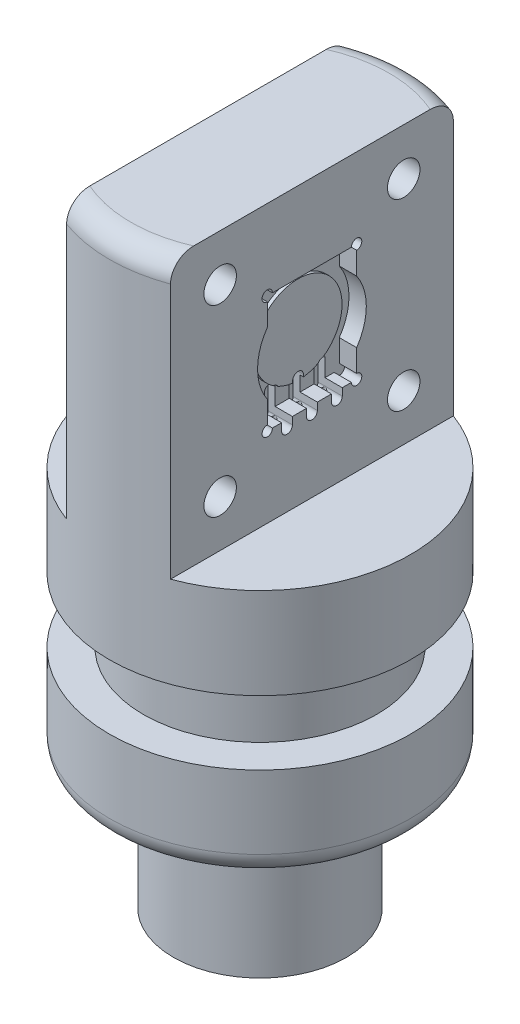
ISO-10303-21;
HEADER;
FILE_DESCRIPTION(('STEP AP214'),'2;1');
FILE_NAME('part.step','',(''),(''),'','','');
FILE_SCHEMA(('AUTOMOTIVE_DESIGN { 1 0 10303 214 1 1 1 1 }'));
ENDSEC;
DATA;
#1=APPLICATION_CONTEXT('core data for automotive mechanical design processes');
#2=APPLICATION_PROTOCOL_DEFINITION('international standard','automotive_design',2000,#1);
#3=PRODUCT_CONTEXT('',#1,'mechanical');
#4=PRODUCT('Part','Part','',(#3));
#5=PRODUCT_RELATED_PRODUCT_CATEGORY('part','',(#4));
#6=PRODUCT_DEFINITION_FORMATION('','',#4);
#7=PRODUCT_DEFINITION_CONTEXT('part definition',#1,'design');
#8=PRODUCT_DEFINITION('design','',#6,#7);
#9=PRODUCT_DEFINITION_SHAPE('','',#8);
#10=(LENGTH_UNIT() NAMED_UNIT(*) SI_UNIT(.MILLI.,.METRE.));
#11=(NAMED_UNIT(*) PLANE_ANGLE_UNIT() SI_UNIT($,.RADIAN.));
#12=(NAMED_UNIT(*) SI_UNIT($,.STERADIAN.) SOLID_ANGLE_UNIT());
#13=UNCERTAINTY_MEASURE_WITH_UNIT(LENGTH_MEASURE(1.E-05),#10,'distance_accuracy_value','');
#14=(GEOMETRIC_REPRESENTATION_CONTEXT(3) GLOBAL_UNCERTAINTY_ASSIGNED_CONTEXT((#13)) GLOBAL_UNIT_ASSIGNED_CONTEXT((#10,
#11,#12)) REPRESENTATION_CONTEXT('',''));
#15=CARTESIAN_POINT('',(0.,0.,0.));
#16=DIRECTION('',(0.,0.,1.));
#17=DIRECTION('',(1.,0.,0.));
#18=AXIS2_PLACEMENT_3D('',#15,#16,#17);
#19=CARTESIAN_POINT('',(3.175,0.,0.));
#20=DIRECTION('',(0.,1.,0.));
#21=DIRECTION('',(0.,0.,1.));
#22=AXIS2_PLACEMENT_3D('',#19,#20,#21);
#23=PLANE('',#22);
#24=CARTESIAN_POINT('',(0.,0.,0.));
#25=DIRECTION('',(0.,1.,0.));
#26=DIRECTION('',(0.,0.,1.));
#27=AXIS2_PLACEMENT_3D('',#24,#25,#26);
#28=CIRCLE('',#27,3.175);
#29=CARTESIAN_POINT('',(0.,0.,3.175));
#30=VERTEX_POINT('',#29);
#31=EDGE_CURVE('E598',#30,#30,#28,.T.);
#32=ORIENTED_EDGE('',*,*,#31,.F.);
#33=EDGE_LOOP('',(#32));
#34=FACE_BOUND('',#33,.T.);
#35=CARTESIAN_POINT('',(0.,0.,0.));
#36=DIRECTION('',(0.,1.,0.));
#37=DIRECTION('',(0.,0.,1.));
#38=AXIS2_PLACEMENT_3D('',#35,#36,#37);
#39=CIRCLE('',#38,1.3843);
#40=CARTESIAN_POINT('',(0.,0.,1.3843));
#41=VERTEX_POINT('',#40);
#42=EDGE_CURVE('E415',#41,#41,#39,.T.);
#43=ORIENTED_EDGE('',*,*,#42,.T.);
#44=EDGE_LOOP('',(#43));
#45=FACE_BOUND('',#44,.T.);
#46=ADVANCED_FACE('F65',(#34,#45),#23,.F.);
#47=CARTESIAN_POINT('',(-0.0212875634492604,13.0096917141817,0.));
#48=DIRECTION('',(0.342020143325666,0.939692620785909,0.));
#49=DIRECTION('',(-0.939692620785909,0.342020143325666,0.));
#50=AXIS2_PLACEMENT_3D('',#47,#48,#49);
#51=CYLINDRICAL_SURFACE('',#50,0.19812);
#52=CARTESIAN_POINT('',(1.29894468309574,16.637,0.));
#53=DIRECTION('',(0.573576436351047,-0.819152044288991,0.));
#54=DIRECTION('',(0.819152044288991,0.573576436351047,0.));
#55=AXIS2_PLACEMENT_3D('',#52,#53,#54);
#56=ELLIPSE('',#55,0.345411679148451,0.19812);
#57=CARTESIAN_POINT('',(1.016,16.43888,0.));
#58=VERTEX_POINT('',#57);
#59=CARTESIAN_POINT('',(1.29894468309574,16.637,-0.19812));
#60=VERTEX_POINT('',#59);
#61=EDGE_CURVE('E1394',#58,#60,#56,.T.);
#62=ORIENTED_EDGE('',*,*,#61,.F.);
#63=CARTESIAN_POINT('',(1.29894468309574,16.637,0.19812));
#64=VERTEX_POINT('',#63);
#65=EDGE_CURVE('E1369',#64,#58,#56,.T.);
#66=ORIENTED_EDGE('',*,*,#65,.F.);
#67=CARTESIAN_POINT('',(1.29894468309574,16.637,0.));
#68=DIRECTION('',(0.819152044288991,0.573576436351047,0.));
#69=DIRECTION('',(0.573576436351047,-0.819152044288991,0.));
#70=AXIS2_PLACEMENT_3D('',#67,#68,#69);
#71=ELLIPSE('',#70,0.24185986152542,0.19812);
#72=EDGE_CURVE('E1390',#60,#64,#71,.F.);
#73=ORIENTED_EDGE('',*,*,#72,.F.);
#74=EDGE_LOOP('',(#62,#66,#73));
#75=FACE_BOUND('',#74,.T.);
#76=CARTESIAN_POINT('',(0.0602396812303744,13.6914095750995,-0.12142246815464));
#77=CARTESIAN_POINT('',(0.0550437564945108,13.6976728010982,-0.112364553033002));
#78=CARTESIAN_POINT('',(0.0507739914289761,13.7039678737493,-0.102787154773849));
#79=CARTESIAN_POINT('',(0.0440940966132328,13.7164306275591,-0.0829315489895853));
#80=CARTESIAN_POINT('',(0.0416847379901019,13.7225982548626,-0.0726530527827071));
#81=CARTESIAN_POINT('',(0.0392918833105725,13.731430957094,-0.0566831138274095));
#82=CARTESIAN_POINT('',(0.038698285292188,13.7343345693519,-0.0512051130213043));
#83=CARTESIAN_POINT('',(0.0378740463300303,13.7398003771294,-0.0400346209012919));
#84=CARTESIAN_POINT('',(0.0376439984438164,13.7423620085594,-0.034341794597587));
#85=CARTESIAN_POINT('',(0.037453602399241,13.7460572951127,-0.0244137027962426));
#86=CARTESIAN_POINT('',(0.0374328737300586,13.7473886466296,-0.0202561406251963));
#87=CARTESIAN_POINT('',(0.0374301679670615,13.7493828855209,-0.0118059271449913));
#88=CARTESIAN_POINT('',(0.0374478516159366,13.7500515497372,-0.0075147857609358));
#89=CARTESIAN_POINT('',(0.0374570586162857,13.7504851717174,0.00116616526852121));
#90=CARTESIAN_POINT('',(0.0374482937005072,13.7502401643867,0.0055565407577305));
#91=CARTESIAN_POINT('',(0.037430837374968,13.7489281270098,0.0142367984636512));
#92=CARTESIAN_POINT('',(0.037422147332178,13.7478537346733,0.0185254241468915));
#93=CARTESIAN_POINT('',(0.0374965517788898,13.7449264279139,0.0278034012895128));
#94=CARTESIAN_POINT('',(0.0375990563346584,13.7429582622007,0.0327536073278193));
#95=CARTESIAN_POINT('',(0.0380323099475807,13.7386479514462,0.042481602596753));
#96=CARTESIAN_POINT('',(0.0383635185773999,13.7363050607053,0.0472590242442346));
#97=CARTESIAN_POINT('',(0.0397942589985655,13.7289830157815,0.0614189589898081));
#98=CARTESIAN_POINT('',(0.0413312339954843,13.723716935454,0.0706135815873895));
#99=CARTESIAN_POINT('',(0.0459195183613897,13.7126552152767,0.0890642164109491));
#100=CARTESIAN_POINT('',(0.049055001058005,13.7068466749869,0.0982917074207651));
#101=CARTESIAN_POINT('',(0.0569380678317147,13.6952088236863,0.116001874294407));
#102=CARTESIAN_POINT('',(0.0616832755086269,13.6893795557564,0.124485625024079));
#103=CARTESIAN_POINT('',(0.0732222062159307,13.6773228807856,0.141129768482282));
#104=CARTESIAN_POINT('',(0.0801568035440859,13.6711042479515,0.149199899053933));
#105=CARTESIAN_POINT('',(0.0956891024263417,13.6588978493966,0.163773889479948));
#106=CARTESIAN_POINT('',(0.104287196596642,13.6529101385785,0.170277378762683));
#107=CARTESIAN_POINT('',(0.121991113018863,13.6417812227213,0.180891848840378));
#108=CARTESIAN_POINT('',(0.130982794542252,13.6366121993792,0.185164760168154));
#109=CARTESIAN_POINT('',(0.149768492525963,13.6265966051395,0.191959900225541));
#110=CARTESIAN_POINT('',(0.15956222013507,13.6217499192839,0.19448275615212));
#111=CARTESIAN_POINT('',(0.179317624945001,13.6125567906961,0.197624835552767));
#112=CARTESIAN_POINT('',(0.189265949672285,13.6081998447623,0.198297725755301));
#113=CARTESIAN_POINT('',(0.209278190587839,13.5998561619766,0.197862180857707));
#114=CARTESIAN_POINT('',(0.219342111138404,13.5958694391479,0.196753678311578));
#115=CARTESIAN_POINT('',(0.239327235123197,13.5882666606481,0.192769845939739));
#116=CARTESIAN_POINT('',(0.249247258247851,13.5846529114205,0.189884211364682));
#117=CARTESIAN_POINT('',(0.268578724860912,13.5778409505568,0.182417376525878));
#118=CARTESIAN_POINT('',(0.277990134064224,13.5746427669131,0.177836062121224));
#119=CARTESIAN_POINT('',(0.296144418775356,13.5686368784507,0.167031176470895));
#120=CARTESIAN_POINT('',(0.304876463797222,13.5658350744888,0.160786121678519));
#121=CARTESIAN_POINT('',(0.321262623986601,13.5606886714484,0.146858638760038));
#122=CARTESIAN_POINT('',(0.328916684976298,13.5583440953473,0.139176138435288));
#123=CARTESIAN_POINT('',(0.342971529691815,13.5541083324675,0.122521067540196));
#124=CARTESIAN_POINT('',(0.349361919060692,13.5522208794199,0.113538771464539));
#125=CARTESIAN_POINT('',(0.360616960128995,13.5489351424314,0.0945833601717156));
#126=CARTESIAN_POINT('',(0.36548160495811,13.5475368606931,0.0846102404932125));
#127=CARTESIAN_POINT('',(0.373536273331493,13.5452384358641,0.0639520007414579));
#128=CARTESIAN_POINT('',(0.376725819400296,13.5443384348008,0.0532666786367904));
#129=CARTESIAN_POINT('',(0.381328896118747,13.5430436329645,0.0314906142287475));
#130=CARTESIAN_POINT('',(0.382742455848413,13.5426488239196,0.0203998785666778));
#131=CARTESIAN_POINT('',(0.383748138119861,13.5423676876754,-0.00184037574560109));
#132=CARTESIAN_POINT('',(0.383345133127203,13.5424800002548,-0.0129896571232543));
#133=CARTESIAN_POINT('',(0.380741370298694,13.5432091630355,-0.035059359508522));
#134=CARTESIAN_POINT('',(0.378540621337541,13.5438260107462,-0.0459797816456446));
#135=CARTESIAN_POINT('',(0.372411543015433,13.5455592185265,-0.0672755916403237));
#136=CARTESIAN_POINT('',(0.368484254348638,13.5466752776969,-0.0776513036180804));
#137=CARTESIAN_POINT('',(0.359023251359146,13.5493991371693,-0.0975725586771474));
#138=CARTESIAN_POINT('',(0.353489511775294,13.5510069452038,-0.107118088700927));
#139=CARTESIAN_POINT('',(0.340969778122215,13.5547084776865,-0.12513284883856));
#140=CARTESIAN_POINT('',(0.333980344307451,13.5568033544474,-0.133599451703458));
#141=CARTESIAN_POINT('',(0.318770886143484,13.5614646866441,-0.149191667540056));
#142=CARTESIAN_POINT('',(0.310550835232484,13.564031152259,-0.156317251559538));
#143=CARTESIAN_POINT('',(0.293119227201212,13.5696259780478,-0.169035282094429));
#144=CARTESIAN_POINT('',(0.283906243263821,13.5726550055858,-0.174625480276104));
#145=CARTESIAN_POINT('',(0.264784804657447,13.5791568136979,-0.184098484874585));
#146=CARTESIAN_POINT('',(0.254876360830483,13.5826295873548,-0.187981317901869));
#147=CARTESIAN_POINT('',(0.234729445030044,13.5899825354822,-0.193911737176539));
#148=CARTESIAN_POINT('',(0.224492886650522,13.5938605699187,-0.195968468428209));
#149=CARTESIAN_POINT('',(0.203974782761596,13.6020168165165,-0.198221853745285));
#150=CARTESIAN_POINT('',(0.193693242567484,13.606294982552,-0.198418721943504));
#151=CARTESIAN_POINT('',(0.173557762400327,13.615167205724,-0.196965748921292));
#152=CARTESIAN_POINT('',(0.163700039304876,13.6197565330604,-0.195339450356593));
#153=CARTESIAN_POINT('',(0.144602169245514,13.6292651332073,-0.190346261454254));
#154=CARTESIAN_POINT('',(0.135362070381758,13.6341844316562,-0.186979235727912));
#155=CARTESIAN_POINT('',(0.117899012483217,13.6442547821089,-0.178685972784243));
#156=CARTESIAN_POINT('',(0.109666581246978,13.6494029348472,-0.173776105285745));
#157=CARTESIAN_POINT('',(0.0943697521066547,13.6599196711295,-0.162584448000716));
#158=CARTESIAN_POINT('',(0.0873041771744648,13.6652880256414,-0.1563040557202));
#159=CARTESIAN_POINT('',(0.0769253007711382,13.6741307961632,-0.145187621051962));
#160=CARTESIAN_POINT('',(0.0731986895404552,13.677560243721,-0.140693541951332));
#161=CARTESIAN_POINT('',(0.066299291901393,13.6844597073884,-0.131327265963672));
#162=CARTESIAN_POINT('',(0.0631265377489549,13.6879297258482,-0.126455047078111));
#163=CARTESIAN_POINT('',(0.0602396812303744,13.6914095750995,-0.12142246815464));
#164=B_SPLINE_CURVE_WITH_KNOTS('',3,(#76,#77,#78,#79,#80,#81,#82,#83,#84,#85,#86,#87,#88,#89,
#90,#91,#92,#93,#94,#95,#96,#97,#98,#99,#100,#101,#102,#103,#104,#105,#106,#107,#108,#109,#110,
#111,#112,#113,#114,#115,#116,#117,#118,#119,#120,#121,#122,#123,#124,#125,#126,#127,#128,#129,
#130,#131,#132,#133,#134,#135,#136,#137,#138,#139,#140,#141,#142,#143,#144,#145,#146,#147,#148,
#149,#150,#151,#152,#153,#154,#155,#156,#157,#158,#159,#160,#161,#162,#163),.UNSPECIFIED.,.T.,
.F.,(4,2,2,2,2,2,2,2,2,2,2,2,2,2,2,2,2,2,2,2,2,2,2,2,2,2,2,2,2,2,2,2,2,2,2,2,2,2,2,2,2,2,2,4),
(0.,0.0365062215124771,0.0730275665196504,0.0916986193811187,0.110400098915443,
0.123466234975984,0.136417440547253,0.149510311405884,0.162720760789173,0.178671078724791,
0.194653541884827,0.226668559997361,0.260576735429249,0.294435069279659,0.331199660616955,
0.367972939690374,0.40145813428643,0.434931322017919,0.467422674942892,0.499915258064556,
0.532598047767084,0.565283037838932,0.598412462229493,0.631543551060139,0.664936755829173,
0.698330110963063,0.731732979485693,0.765135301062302,0.798448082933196,0.831760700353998,
0.865053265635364,0.898346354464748,0.931719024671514,0.965092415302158,0.998514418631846,
1.0319359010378,1.06518905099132,1.09843837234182,1.13126323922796,1.16409065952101,
1.1965809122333,1.22903818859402,1.24931986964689,1.26960273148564),.UNSPECIFIED.);
#165=CARTESIAN_POINT('',(0.0602396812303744,13.6914095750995,-0.12142246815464));
#166=VERTEX_POINT('',#165);
#167=EDGE_CURVE('E378',#166,#166,#164,.T.);
#168=ORIENTED_EDGE('',*,*,#167,.F.);
#169=EDGE_LOOP('',(#168));
#170=FACE_BOUND('',#169,.T.);
#171=ADVANCED_FACE('F395',(#75,#170),#51,.F.);
#172=CARTESIAN_POINT('',(-0.0212875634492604,13.0096917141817,-0.9144));
#173=DIRECTION('',(0.342020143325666,0.939692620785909,0.));
#174=DIRECTION('',(-0.939692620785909,0.342020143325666,0.));
#175=AXIS2_PLACEMENT_3D('',#172,#173,#174);
#176=CYLINDRICAL_SURFACE('',#175,0.19812);
#177=CARTESIAN_POINT('',(1.29894468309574,16.637,-0.9144));
#178=DIRECTION('',(0.573576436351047,-0.819152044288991,0.));
#179=DIRECTION('',(0.819152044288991,0.573576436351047,0.));
#180=AXIS2_PLACEMENT_3D('',#177,#178,#179);
#181=ELLIPSE('',#180,0.345411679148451,0.19812);
#182=CARTESIAN_POINT('',(1.016,16.43888,-0.9144));
#183=VERTEX_POINT('',#182);
#184=CARTESIAN_POINT('',(1.29894468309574,16.637,-1.11252));
#185=VERTEX_POINT('',#184);
#186=EDGE_CURVE('E1400',#183,#185,#181,.T.);
#187=ORIENTED_EDGE('',*,*,#186,.F.);
#188=CARTESIAN_POINT('',(1.29894468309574,16.637,-0.71628));
#189=VERTEX_POINT('',#188);
#190=EDGE_CURVE('E1402',#189,#183,#181,.T.);
#191=ORIENTED_EDGE('',*,*,#190,.F.);
#192=CARTESIAN_POINT('',(1.29894468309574,16.637,-0.9144));
#193=DIRECTION('',(0.819152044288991,0.573576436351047,0.));
#194=DIRECTION('',(0.573576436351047,-0.819152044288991,0.));
#195=AXIS2_PLACEMENT_3D('',#192,#193,#194);
#196=ELLIPSE('',#195,0.24185986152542,0.19812);
#197=EDGE_CURVE('E91',#185,#189,#196,.F.);
#198=ORIENTED_EDGE('',*,*,#197,.F.);
#199=EDGE_LOOP('',(#187,#191,#198));
#200=FACE_BOUND('',#199,.T.);
#201=CARTESIAN_POINT('',(-0.149993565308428,13.1570219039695,-1.01387966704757));
#202=CARTESIAN_POINT('',(-0.154073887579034,13.1625101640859,-1.00404275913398));
#203=CARTESIAN_POINT('',(-0.157044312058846,13.1682570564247,-0.99389168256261));
#204=CARTESIAN_POINT('',(-0.160894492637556,13.1800561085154,-0.973377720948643));
#205=CARTESIAN_POINT('',(-0.161771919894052,13.1861086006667,-0.963014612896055));
#206=CARTESIAN_POINT('',(-0.161645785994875,13.198289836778,-0.942473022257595));
#207=CARTESIAN_POINT('',(-0.160657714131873,13.2044175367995,-0.932293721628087));
#208=CARTESIAN_POINT('',(-0.15704919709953,13.216662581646,-0.912235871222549));
#209=CARTESIAN_POINT('',(-0.15442900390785,13.2227799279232,-0.902357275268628));
#210=CARTESIAN_POINT('',(-0.147100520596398,13.2360797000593,-0.881148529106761));
#211=CARTESIAN_POINT('',(-0.142085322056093,13.2432379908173,-0.869909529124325));
#212=CARTESIAN_POINT('',(-0.130266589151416,13.2572379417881,-0.848192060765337));
#213=CARTESIAN_POINT('',(-0.123460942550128,13.2640792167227,-0.837714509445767));
#214=CARTESIAN_POINT('',(-0.106732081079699,13.2786128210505,-0.815632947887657));
#215=CARTESIAN_POINT('',(-0.0964573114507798,13.2862004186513,-0.80422484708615));
#216=CARTESIAN_POINT('',(-0.0738478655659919,13.3003787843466,-0.782918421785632));
#217=CARTESIAN_POINT('',(-0.0615133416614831,13.3069696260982,-0.773019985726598));
#218=CARTESIAN_POINT('',(-0.0375729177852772,13.3175834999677,-0.756831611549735));
#219=CARTESIAN_POINT('',(-0.0262992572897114,13.3218566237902,-0.75021474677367));
#220=CARTESIAN_POINT('',(-0.00265298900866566,13.3292046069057,-0.738441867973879));
#221=CARTESIAN_POINT('',(0.00971764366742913,13.3322815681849,-0.733283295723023));
#222=CARTESIAN_POINT('',(0.0324871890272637,13.3363894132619,-0.725739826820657));
#223=CARTESIAN_POINT('',(0.0427104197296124,13.337723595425,-0.72299290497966));
#224=CARTESIAN_POINT('',(0.0635109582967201,13.3393086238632,-0.718814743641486));
#225=CARTESIAN_POINT('',(0.0740880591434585,13.3395600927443,-0.71738274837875));
#226=CARTESIAN_POINT('',(0.0954011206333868,13.3388584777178,-0.716039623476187));
#227=CARTESIAN_POINT('',(0.106137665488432,13.3378950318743,-0.716141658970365));
#228=CARTESIAN_POINT('',(0.127271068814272,13.334723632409,-0.718049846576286));
#229=CARTESIAN_POINT('',(0.137668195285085,13.3325166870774,-0.719854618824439));
#230=CARTESIAN_POINT('',(0.156311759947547,13.3273573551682,-0.724808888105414));
#231=CARTESIAN_POINT('',(0.164657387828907,13.3245491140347,-0.727739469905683));
#232=CARTESIAN_POINT('',(0.180540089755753,13.3182330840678,-0.734791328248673));
#233=CARTESIAN_POINT('',(0.188077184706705,13.3147253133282,-0.738912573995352));
#234=CARTESIAN_POINT('',(0.202027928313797,13.3072517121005,-0.748111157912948));
#235=CARTESIAN_POINT('',(0.208460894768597,13.3032963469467,-0.753167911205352));
#236=CARTESIAN_POINT('',(0.220287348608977,13.2950269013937,-0.764127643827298));
#237=CARTESIAN_POINT('',(0.225680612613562,13.2907127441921,-0.770030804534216));
#238=CARTESIAN_POINT('',(0.235860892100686,13.2814236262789,-0.78313465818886));
#239=CARTESIAN_POINT('',(0.240535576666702,13.2764254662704,-0.790405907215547));
#240=CARTESIAN_POINT('',(0.248565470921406,13.2663047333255,-0.805561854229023));
#241=CARTESIAN_POINT('',(0.251920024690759,13.2611820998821,-0.813446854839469));
#242=CARTESIAN_POINT('',(0.257717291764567,13.250191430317,-0.830800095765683));
#243=CARTESIAN_POINT('',(0.259961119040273,13.2443215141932,-0.840333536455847));
#244=CARTESIAN_POINT('',(0.262812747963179,13.2326921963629,-0.859705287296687));
#245=CARTESIAN_POINT('',(0.263419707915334,13.2269328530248,-0.869543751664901));
#246=CARTESIAN_POINT('',(0.263047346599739,13.2148017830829,-0.890729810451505));
#247=CARTESIAN_POINT('',(0.261827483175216,13.2084610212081,-0.902091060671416));
#248=CARTESIAN_POINT('',(0.257470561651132,13.1961437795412,-0.924641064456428));
#249=CARTESIAN_POINT('',(0.254332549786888,13.1901674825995,-0.935829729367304));
#250=CARTESIAN_POINT('',(0.245801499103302,13.1779874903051,-0.959052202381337));
#251=CARTESIAN_POINT('',(0.240189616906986,13.1718374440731,-0.971034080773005));
#252=CARTESIAN_POINT('',(0.226926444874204,13.1601687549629,-0.994147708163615));
#253=CARTESIAN_POINT('',(0.219274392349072,13.1546503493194,-1.00527913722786));
#254=CARTESIAN_POINT('',(0.20157168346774,13.1439897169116,-1.02707068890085));
#255=CARTESIAN_POINT('',(0.191398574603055,13.1388943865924,-1.03765467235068));
#256=CARTESIAN_POINT('',(0.169206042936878,13.1296018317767,-1.05716773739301));
#257=CARTESIAN_POINT('',(0.157185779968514,13.1254050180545,-1.06609606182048));
#258=CARTESIAN_POINT('',(0.131704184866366,13.1180594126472,-1.08185693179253));
#259=CARTESIAN_POINT('',(0.118256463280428,13.1149017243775,-1.08870722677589));
#260=CARTESIAN_POINT('',(0.0901929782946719,13.1097279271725,-1.10002854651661));
#261=CARTESIAN_POINT('',(0.0755790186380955,13.1077100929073,-1.10450316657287));
#262=CARTESIAN_POINT('',(0.0494402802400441,13.1053296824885,-1.10990196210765));
#263=CARTESIAN_POINT('',(0.0380665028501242,13.1046779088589,-1.11143712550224));
#264=CARTESIAN_POINT('',(0.0151935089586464,13.1041894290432,-1.11279765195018));
#265=CARTESIAN_POINT('',(0.00369434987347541,13.1043523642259,-1.11262376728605));
#266=CARTESIAN_POINT('',(-0.0191710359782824,13.1055803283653,-1.11042166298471));
#267=CARTESIAN_POINT('',(-0.0305356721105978,13.1066519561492,-1.1083798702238));
#268=CARTESIAN_POINT('',(-0.0525993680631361,13.1097707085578,-1.10235570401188));
#269=CARTESIAN_POINT('',(-0.0632990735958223,13.1118168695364,-1.09837524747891));
#270=CARTESIAN_POINT('',(-0.0822122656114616,13.116560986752,-1.08919237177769));
#271=CARTESIAN_POINT('',(-0.0905677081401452,13.119137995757,-1.08421919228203));
#272=CARTESIAN_POINT('',(-0.106102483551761,13.1249957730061,-1.07301351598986));
#273=CARTESIAN_POINT('',(-0.113282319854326,13.1282762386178,-1.06678156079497));
#274=CARTESIAN_POINT('',(-0.126324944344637,13.1355070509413,-1.05319765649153));
#275=CARTESIAN_POINT('',(-0.132167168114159,13.139466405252,-1.0458308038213));
#276=CARTESIAN_POINT('',(-0.142271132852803,13.1478955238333,-1.030344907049));
#277=CARTESIAN_POINT('',(-0.146531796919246,13.1523656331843,-1.02222535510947));
#278=CARTESIAN_POINT('',(-0.149993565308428,13.1570219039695,-1.01387966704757));
#279=B_SPLINE_CURVE_WITH_KNOTS('',3,(#201,#202,#203,#204,#205,#206,#207,#208,#209,#210,#211,
#212,#213,#214,#215,#216,#217,#218,#219,#220,#221,#222,#223,#224,#225,#226,#227,#228,#229,#230,
#231,#232,#233,#234,#235,#236,#237,#238,#239,#240,#241,#242,#243,#244,#245,#246,#247,#248,#249,
#250,#251,#252,#253,#254,#255,#256,#257,#258,#259,#260,#261,#262,#263,#264,#265,#266,#267,#268,
#269,#270,#271,#272,#273,#274,#275,#276,#277,#278),.UNSPECIFIED.,.T.,.F.,(4,2,2,2,2,2,2,2,2,2,2,
2,2,2,2,2,2,2,2,2,2,2,2,2,2,2,2,2,2,2,2,2,2,2,2,2,2,2,4),(0.,0.0358949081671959,
0.0718297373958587,0.107467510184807,0.143099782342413,0.185659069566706,0.228268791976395,
0.279429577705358,0.330586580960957,0.371701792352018,0.412744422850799,0.444632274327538,
0.476501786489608,0.508644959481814,0.540762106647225,0.568464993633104,0.596167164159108,
0.623319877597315,0.650478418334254,0.680316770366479,0.710169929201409,0.744290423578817,
0.778428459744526,0.817473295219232,0.856537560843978,0.900120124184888,0.943719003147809,
0.990116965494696,1.03653609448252,1.08254678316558,1.12848764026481,1.16283605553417,
1.19716935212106,1.23175412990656,1.26630478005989,1.29631627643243,1.32631488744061,
1.35674764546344,1.38720108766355),.UNSPECIFIED.);
#280=CARTESIAN_POINT('',(-0.149993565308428,13.1570219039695,-1.01387966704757));
#281=VERTEX_POINT('',#280);
#282=EDGE_CURVE('E381',#281,#281,#279,.T.);
#283=ORIENTED_EDGE('',*,*,#282,.F.);
#284=EDGE_LOOP('',(#283));
#285=FACE_BOUND('',#284,.T.);
#286=ADVANCED_FACE('F469',(#200,#285),#176,.F.);
#287=CARTESIAN_POINT('',(-0.0212875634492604,13.0096917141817,0.9144));
#288=DIRECTION('',(0.342020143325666,0.939692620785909,0.));
#289=DIRECTION('',(-0.939692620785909,0.342020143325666,0.));
#290=AXIS2_PLACEMENT_3D('',#287,#288,#289);
#291=CYLINDRICAL_SURFACE('',#290,0.19812);
#292=CARTESIAN_POINT('',(1.29894468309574,16.637,0.9144));
#293=DIRECTION('',(0.573576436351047,-0.819152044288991,0.));
#294=DIRECTION('',(0.819152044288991,0.573576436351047,0.));
#295=AXIS2_PLACEMENT_3D('',#292,#293,#294);
#296=ELLIPSE('',#295,0.345411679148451,0.19812);
#297=CARTESIAN_POINT('',(1.016,16.43888,0.9144));
#298=VERTEX_POINT('',#297);
#299=CARTESIAN_POINT('',(1.29894468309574,16.637,0.71628));
#300=VERTEX_POINT('',#299);
#301=EDGE_CURVE('E380',#298,#300,#296,.T.);
#302=ORIENTED_EDGE('',*,*,#301,.F.);
#303=CARTESIAN_POINT('',(1.29894468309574,16.637,1.11252));
#304=VERTEX_POINT('',#303);
#305=EDGE_CURVE('E383',#304,#298,#296,.T.);
#306=ORIENTED_EDGE('',*,*,#305,.F.);
#307=CARTESIAN_POINT('',(1.29894468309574,16.637,0.9144));
#308=DIRECTION('',(0.819152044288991,0.573576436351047,0.));
#309=DIRECTION('',(0.573576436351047,-0.819152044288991,0.));
#310=AXIS2_PLACEMENT_3D('',#307,#308,#309);
#311=ELLIPSE('',#310,0.24185986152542,0.19812);
#312=EDGE_CURVE('E83',#300,#304,#311,.F.);
#313=ORIENTED_EDGE('',*,*,#312,.F.);
#314=EDGE_LOOP('',(#302,#306,#313));
#315=FACE_BOUND('',#314,.T.);
#316=CARTESIAN_POINT('',(-0.148307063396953,13.2336088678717,0.885113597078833));
#317=CARTESIAN_POINT('',(-0.152679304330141,13.2265106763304,0.896359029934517));
#318=CARTESIAN_POINT('',(-0.156086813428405,13.219314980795,0.907922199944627));
#319=CARTESIAN_POINT('',(-0.160660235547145,13.2049009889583,0.931476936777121));
#320=CARTESIAN_POINT('',(-0.161828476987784,13.1976827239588,0.943468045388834));
#321=CARTESIAN_POINT('',(-0.161602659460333,13.1849130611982,0.965060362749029));
#322=CARTESIAN_POINT('',(-0.160687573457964,13.1793250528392,0.974644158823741));
#323=CARTESIAN_POINT('',(-0.157061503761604,13.168411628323,0.993627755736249));
#324=CARTESIAN_POINT('',(-0.154351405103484,13.1630860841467,1.00302764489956));
#325=CARTESIAN_POINT('',(-0.146997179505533,13.1528221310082,1.02139277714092));
#326=CARTESIAN_POINT('',(-0.142337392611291,13.1478872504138,1.03035382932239));
#327=CARTESIAN_POINT('',(-0.131098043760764,13.1386438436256,1.04734887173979));
#328=CARTESIAN_POINT('',(-0.124520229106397,13.1343347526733,1.05538369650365));
#329=CARTESIAN_POINT('',(-0.110659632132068,13.1270421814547,1.06912089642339));
#330=CARTESIAN_POINT('',(-0.103595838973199,13.1239580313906,1.07499195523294));
#331=CARTESIAN_POINT('',(-0.0884056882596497,13.1184492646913,1.08554596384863));
#332=CARTESIAN_POINT('',(-0.0802795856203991,13.1160244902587,1.0902291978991));
#333=CARTESIAN_POINT('',(-0.0636597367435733,13.1119674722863,1.09808568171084));
#334=CARTESIAN_POINT('',(-0.0552032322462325,13.110302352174,1.10132141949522));
#335=CARTESIAN_POINT('',(-0.0378271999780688,13.1075908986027,1.10657022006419));
#336=CARTESIAN_POINT('',(-0.0289076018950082,13.1065446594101,1.10858309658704));
#337=CARTESIAN_POINT('',(-0.0102030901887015,13.1049917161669,1.11150284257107));
#338=CARTESIAN_POINT('',(-0.000401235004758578,13.104527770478,1.11232270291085));
#339=CARTESIAN_POINT('',(0.0192319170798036,13.1042288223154,1.1126542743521));
#340=CARTESIAN_POINT('',(0.0290632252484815,13.104394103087,1.11216539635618));
#341=CARTESIAN_POINT('',(0.0498756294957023,13.105362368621,1.10982581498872));
#342=CARTESIAN_POINT('',(0.0608331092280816,13.1062482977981,1.10780045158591));
#343=CARTESIAN_POINT('',(0.0823116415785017,13.1086884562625,1.10233999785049));
#344=CARTESIAN_POINT('',(0.0928324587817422,13.1102430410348,1.09890415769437));
#345=CARTESIAN_POINT('',(0.114818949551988,13.1142384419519,1.09015575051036));
#346=CARTESIAN_POINT('',(0.126184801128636,13.1167781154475,1.08463716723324));
#347=CARTESIAN_POINT('',(0.147893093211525,13.1225742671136,1.07215484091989));
#348=CARTESIAN_POINT('',(0.158234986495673,13.1258311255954,1.06519033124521));
#349=CARTESIAN_POINT('',(0.178961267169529,13.1334488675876,1.04906129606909));
#350=CARTESIAN_POINT('',(0.18918378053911,13.1378974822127,1.03972962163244));
#351=CARTESIAN_POINT('',(0.207889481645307,13.1475340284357,1.01979013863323));
#352=CARTESIAN_POINT('',(0.216371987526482,13.1527222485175,1.0091818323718));
#353=CARTESIAN_POINT('',(0.231912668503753,13.1641397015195,0.986221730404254));
#354=CARTESIAN_POINT('',(0.238834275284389,13.1704157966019,0.973800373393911));
#355=CARTESIAN_POINT('',(0.250237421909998,13.1836321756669,0.948202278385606));
#356=CARTESIAN_POINT('',(0.254718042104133,13.1905727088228,0.935025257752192));
#357=CARTESIAN_POINT('',(0.260985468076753,13.2049352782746,0.908450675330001));
#358=CARTESIAN_POINT('',(0.262796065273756,13.2123524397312,0.895056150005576));
#359=CARTESIAN_POINT('',(0.263586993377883,13.2275639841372,0.868400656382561));
#360=CARTESIAN_POINT('',(0.262571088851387,13.235357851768,0.855139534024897));
#361=CARTESIAN_POINT('',(0.258123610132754,13.2492561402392,0.832304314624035));
#362=CARTESIAN_POINT('',(0.255309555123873,13.255331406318,0.822590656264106));
#363=CARTESIAN_POINT('',(0.247853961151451,13.2674191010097,0.803839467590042));
#364=CARTESIAN_POINT('',(0.243212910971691,13.2734315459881,0.794801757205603));
#365=CARTESIAN_POINT('',(0.232043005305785,13.2852297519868,0.777665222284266));
#366=CARTESIAN_POINT('',(0.225500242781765,13.2910134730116,0.769573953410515));
#367=CARTESIAN_POINT('',(0.210609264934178,13.3020178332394,0.754784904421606));
#368=CARTESIAN_POINT('',(0.202263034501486,13.307239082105,0.748085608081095));
#369=CARTESIAN_POINT('',(0.18524712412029,13.3161177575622,0.737243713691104));
#370=CARTESIAN_POINT('',(0.176781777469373,13.3198915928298,0.7328756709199));
#371=CARTESIAN_POINT('',(0.1589207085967,13.3265470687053,0.725619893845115));
#372=CARTESIAN_POINT('',(0.149525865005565,13.3294295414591,0.72273077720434));
#373=CARTESIAN_POINT('',(0.131228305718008,13.3338741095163,0.718746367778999));
#374=CARTESIAN_POINT('',(0.122387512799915,13.3355475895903,0.717486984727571));
#375=CARTESIAN_POINT('',(0.104498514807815,13.3380090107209,0.716170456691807));
#376=CARTESIAN_POINT('',(0.0954503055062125,13.3387969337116,0.716113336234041));
#377=CARTESIAN_POINT('',(0.0772242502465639,13.3395074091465,0.717120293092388));
#378=CARTESIAN_POINT('',(0.068046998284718,13.3394141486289,0.718204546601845));
#379=CARTESIAN_POINT('',(0.0499215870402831,13.3383961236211,0.721390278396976));
#380=CARTESIAN_POINT('',(0.0409735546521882,13.3374709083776,0.723492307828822));
#381=CARTESIAN_POINT('',(0.0194194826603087,13.3342941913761,0.729740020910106));
#382=CARTESIAN_POINT('',(0.00701707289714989,13.3316291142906,0.734380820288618));
#383=CARTESIAN_POINT('',(-0.016778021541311,13.3250625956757,0.745154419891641));
#384=CARTESIAN_POINT('',(-0.028168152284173,13.3211581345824,0.751290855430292));
#385=CARTESIAN_POINT('',(-0.0528078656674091,13.3111810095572,0.766650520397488));
#386=CARTESIAN_POINT('',(-0.0656958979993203,13.304807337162,0.776257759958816));
#387=CARTESIAN_POINT('',(-0.0894129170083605,13.2909660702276,0.797067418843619));
#388=CARTESIAN_POINT('',(-0.100241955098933,13.2834985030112,0.808269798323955));
#389=CARTESIAN_POINT('',(-0.118063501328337,13.2690692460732,0.830109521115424));
#390=CARTESIAN_POINT('',(-0.125392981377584,13.2622196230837,0.840547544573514));
#391=CARTESIAN_POINT('',(-0.13825906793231,13.2481507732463,0.862249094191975));
#392=CARTESIAN_POINT('',(-0.143796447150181,13.2409317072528,0.873512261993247));
#393=CARTESIAN_POINT('',(-0.148307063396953,13.2336088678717,0.885113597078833));
#394=B_SPLINE_CURVE_WITH_KNOTS('',3,(#316,#317,#318,#319,#320,#321,#322,#323,#324,#325,#326,
#327,#328,#329,#330,#331,#332,#333,#334,#335,#336,#337,#338,#339,#340,#341,#342,#343,#344,#345,
#346,#347,#348,#349,#350,#351,#352,#353,#354,#355,#356,#357,#358,#359,#360,#361,#362,#363,#364,
#365,#366,#367,#368,#369,#370,#371,#372,#373,#374,#375,#376,#377,#378,#379,#380,#381,#382,#383,
#384,#385,#386,#387,#388,#389,#390,#391,#392,#393),.UNSPECIFIED.,.T.,.F.,(4,2,2,2,2,2,2,2,2,2,2,
2,2,2,2,2,2,2,2,2,2,2,2,2,2,2,2,2,2,2,2,2,2,2,2,2,2,2,4),(0.,0.0419573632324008,
0.0838710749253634,0.117136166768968,0.150384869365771,0.183905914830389,0.217396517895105,
0.246312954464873,0.275222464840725,0.30272246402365,0.330226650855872,0.359650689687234,
0.389087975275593,0.42249267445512,0.455915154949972,0.494423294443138,0.532951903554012,
0.576380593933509,0.619826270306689,0.666234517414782,0.712660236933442,0.75866972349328,
0.804617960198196,0.839867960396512,0.875108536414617,0.910613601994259,0.946079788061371,
0.976641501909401,1.00717459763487,1.03430332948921,1.06143261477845,1.08904965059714,
1.11668165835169,1.15698142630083,1.19738014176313,1.24899345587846,1.30060548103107,
1.34390943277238,1.38719468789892),.UNSPECIFIED.);
#395=CARTESIAN_POINT('',(-0.148307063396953,13.2336088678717,0.885113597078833));
#396=VERTEX_POINT('',#395);
#397=EDGE_CURVE('E375',#396,#396,#394,.T.);
#398=ORIENTED_EDGE('',*,*,#397,.F.);
#399=EDGE_LOOP('',(#398));
#400=FACE_BOUND('',#399,.T.);
#401=ADVANCED_FACE('F402',(#315,#400),#291,.F.);
#402=CARTESIAN_POINT('',(1.016,16.637,0.9144));
#403=DIRECTION('',(1.,0.,0.));
#404=DIRECTION('',(0.,1.,0.));
#405=AXIS2_PLACEMENT_3D('',#402,#403,#404);
#406=CYLINDRICAL_SURFACE('',#405,0.19812);
#407=DIRECTION('',(1.,0.,0.));
#408=VECTOR('',#407,1.);
#409=CARTESIAN_POINT('',(1.016,16.637,0.71628));
#410=LINE('',#409,#408);
#411=CARTESIAN_POINT('',(1.905,16.637,0.71628));
#412=VERTEX_POINT('',#411);
#413=EDGE_CURVE('E1261',#300,#412,#410,.T.);
#414=ORIENTED_EDGE('',*,*,#413,.F.);
#415=ORIENTED_EDGE('',*,*,#312,.T.);
#416=DIRECTION('',(1.,0.,0.));
#417=VECTOR('',#416,1.);
#418=CARTESIAN_POINT('',(1.016,16.637,1.11252));
#419=LINE('',#418,#417);
#420=CARTESIAN_POINT('',(1.905,16.637,1.11252));
#421=VERTEX_POINT('',#420);
#422=EDGE_CURVE('E1274',#304,#421,#419,.T.);
#423=ORIENTED_EDGE('',*,*,#422,.T.);
#424=CARTESIAN_POINT('',(1.905,16.637,0.9144));
#425=DIRECTION('',(1.,0.,0.));
#426=DIRECTION('',(0.,1.,0.));
#427=AXIS2_PLACEMENT_3D('',#424,#425,#426);
#428=CIRCLE('',#427,0.19812);
#429=EDGE_CURVE('E1247',#421,#412,#428,.T.);
#430=ORIENTED_EDGE('',*,*,#429,.T.);
#431=EDGE_LOOP('',(#414,#415,#423,#430));
#432=FACE_BOUND('',#431,.T.);
#433=ADVANCED_FACE('F773',(#432),#406,.F.);
#434=CARTESIAN_POINT('',(1.016,16.637,1.11252));
#435=VERTEX_POINT('',#434);
#436=EDGE_CURVE('E1270',#435,#304,#419,.T.);
#437=ORIENTED_EDGE('',*,*,#436,.T.);
#438=ORIENTED_EDGE('',*,*,#305,.T.);
#439=CARTESIAN_POINT('',(1.016,16.637,0.9144));
#440=DIRECTION('',(1.,0.,0.));
#441=DIRECTION('',(0.,1.,0.));
#442=AXIS2_PLACEMENT_3D('',#439,#440,#441);
#443=CIRCLE('',#442,0.19812);
#444=EDGE_CURVE('E1248',#435,#298,#443,.T.);
#445=ORIENTED_EDGE('',*,*,#444,.F.);
#446=EDGE_LOOP('',(#437,#438,#445));
#447=FACE_BOUND('',#446,.T.);
#448=ADVANCED_FACE('F766',(#447),#406,.F.);
#449=CARTESIAN_POINT('',(1.016,16.637,-0.9144));
#450=DIRECTION('',(1.,0.,0.));
#451=DIRECTION('',(0.,1.,0.));
#452=AXIS2_PLACEMENT_3D('',#449,#450,#451);
#453=CYLINDRICAL_SURFACE('',#452,0.19812);
#454=DIRECTION('',(1.,0.,0.));
#455=VECTOR('',#454,1.);
#456=CARTESIAN_POINT('',(1.016,16.637,-1.11252));
#457=LINE('',#456,#455);
#458=CARTESIAN_POINT('',(1.905,16.637,-1.11252));
#459=VERTEX_POINT('',#458);
#460=EDGE_CURVE('E1196',#185,#459,#457,.T.);
#461=ORIENTED_EDGE('',*,*,#460,.F.);
#462=ORIENTED_EDGE('',*,*,#197,.T.);
#463=DIRECTION('',(1.,0.,0.));
#464=VECTOR('',#463,1.);
#465=CARTESIAN_POINT('',(1.016,16.637,-0.71628));
#466=LINE('',#465,#464);
#467=CARTESIAN_POINT('',(1.905,16.637,-0.71628));
#468=VERTEX_POINT('',#467);
#469=EDGE_CURVE('E1188',#189,#468,#466,.T.);
#470=ORIENTED_EDGE('',*,*,#469,.T.);
#471=CARTESIAN_POINT('',(1.905,16.637,-0.9144));
#472=DIRECTION('',(1.,0.,0.));
#473=DIRECTION('',(0.,1.,0.));
#474=AXIS2_PLACEMENT_3D('',#471,#472,#473);
#475=CIRCLE('',#474,0.19812);
#476=EDGE_CURVE('E1174',#468,#459,#475,.T.);
#477=ORIENTED_EDGE('',*,*,#476,.T.);
#478=EDGE_LOOP('',(#461,#462,#470,#477));
#479=FACE_BOUND('',#478,.T.);
#480=ADVANCED_FACE('F757',(#479),#453,.F.);
#481=CARTESIAN_POINT('',(1.016,16.637,-0.71628));
#482=VERTEX_POINT('',#481);
#483=EDGE_CURVE('E1185',#482,#189,#466,.T.);
#484=ORIENTED_EDGE('',*,*,#483,.T.);
#485=ORIENTED_EDGE('',*,*,#190,.T.);
#486=CARTESIAN_POINT('',(1.016,16.637,-0.9144));
#487=DIRECTION('',(1.,0.,0.));
#488=DIRECTION('',(0.,1.,0.));
#489=AXIS2_PLACEMENT_3D('',#486,#487,#488);
#490=CIRCLE('',#489,0.19812);
#491=EDGE_CURVE('E1179',#482,#183,#490,.T.);
#492=ORIENTED_EDGE('',*,*,#491,.F.);
#493=EDGE_LOOP('',(#484,#485,#492));
#494=FACE_BOUND('',#493,.T.);
#495=ADVANCED_FACE('F750',(#494),#453,.F.);
#496=CARTESIAN_POINT('',(1.016,16.637,0.));
#497=DIRECTION('',(1.,0.,0.));
#498=DIRECTION('',(0.,1.,0.));
#499=AXIS2_PLACEMENT_3D('',#496,#497,#498);
#500=CYLINDRICAL_SURFACE('',#499,0.19812);
#501=DIRECTION('',(1.,0.,0.));
#502=VECTOR('',#501,1.);
#503=CARTESIAN_POINT('',(1.016,16.637,-0.19812));
#504=LINE('',#503,#502);
#505=CARTESIAN_POINT('',(1.905,16.637,-0.19812));
#506=VERTEX_POINT('',#505);
#507=EDGE_CURVE('E1214',#60,#506,#504,.T.);
#508=ORIENTED_EDGE('',*,*,#507,.F.);
#509=ORIENTED_EDGE('',*,*,#72,.T.);
#510=DIRECTION('',(1.,0.,0.));
#511=VECTOR('',#510,1.);
#512=CARTESIAN_POINT('',(1.016,16.637,0.19812));
#513=LINE('',#512,#511);
#514=CARTESIAN_POINT('',(1.905,16.637,0.19812));
#515=VERTEX_POINT('',#514);
#516=EDGE_CURVE('E1225',#64,#515,#513,.T.);
#517=ORIENTED_EDGE('',*,*,#516,.T.);
#518=CARTESIAN_POINT('',(1.905,16.637,0.));
#519=DIRECTION('',(1.,0.,0.));
#520=DIRECTION('',(0.,1.,0.));
#521=AXIS2_PLACEMENT_3D('',#518,#519,#520);
#522=CIRCLE('',#521,0.19812);
#523=EDGE_CURVE('E1200',#515,#506,#522,.T.);
#524=ORIENTED_EDGE('',*,*,#523,.T.);
#525=EDGE_LOOP('',(#508,#509,#517,#524));
#526=FACE_BOUND('',#525,.T.);
#527=ADVANCED_FACE('F741',(#526),#500,.F.);
#528=CARTESIAN_POINT('',(1.016,16.637,0.19812));
#529=VERTEX_POINT('',#528);
#530=EDGE_CURVE('E1221',#529,#64,#513,.T.);
#531=ORIENTED_EDGE('',*,*,#530,.T.);
#532=ORIENTED_EDGE('',*,*,#65,.T.);
#533=CARTESIAN_POINT('',(1.016,16.637,0.));
#534=DIRECTION('',(1.,0.,0.));
#535=DIRECTION('',(0.,1.,0.));
#536=AXIS2_PLACEMENT_3D('',#533,#534,#535);
#537=CIRCLE('',#536,0.19812);
#538=EDGE_CURVE('E1201',#529,#58,#537,.T.);
#539=ORIENTED_EDGE('',*,*,#538,.F.);
#540=EDGE_LOOP('',(#531,#532,#539));
#541=FACE_BOUND('',#540,.T.);
#542=ADVANCED_FACE('F734',(#541),#500,.F.);
#543=CARTESIAN_POINT('',(1.397,16.9037,-1.6383));
#544=DIRECTION('',(0.,-1.,0.));
#545=DIRECTION('',(1.,0.,0.));
#546=AXIS2_PLACEMENT_3D('',#543,#544,#545);
#547=PLANE('',#546);
#548=DIRECTION('',(0.,0.,-1.));
#549=VECTOR('',#548,1.);
#550=CARTESIAN_POINT('',(1.905,16.9037,-1.6383));
#551=LINE('',#550,#549);
#552=CARTESIAN_POINT('',(1.905,16.9037,-0.19812));
#553=VERTEX_POINT('',#552);
#554=CARTESIAN_POINT('',(1.905,16.9037,-0.71628));
#555=VERTEX_POINT('',#554);
#556=EDGE_CURVE('E1155',#553,#555,#551,.T.);
#557=ORIENTED_EDGE('',*,*,#556,.T.);
#558=DIRECTION('',(-1.,0.,0.));
#559=VECTOR('',#558,1.);
#560=CARTESIAN_POINT('',(1.397,16.9037,-0.71628));
#561=LINE('',#560,#559);
#562=CARTESIAN_POINT('',(1.27,16.9037,-0.71628));
#563=VERTEX_POINT('',#562);
#564=EDGE_CURVE('E1161',#555,#563,#561,.T.);
#565=ORIENTED_EDGE('',*,*,#564,.T.);
#566=DIRECTION('',(0.,0.,-1.));
#567=VECTOR('',#566,1.);
#568=CARTESIAN_POINT('',(1.27,16.9037,1.6383));
#569=LINE('',#568,#567);
#570=CARTESIAN_POINT('',(1.27,16.9037,-0.19812));
#571=VERTEX_POINT('',#570);
#572=EDGE_CURVE('E1325',#571,#563,#569,.T.);
#573=ORIENTED_EDGE('',*,*,#572,.F.);
#574=DIRECTION('',(1.,0.,0.));
#575=VECTOR('',#574,1.);
#576=CARTESIAN_POINT('',(1.397,16.9037,-0.19812));
#577=LINE('',#576,#575);
#578=EDGE_CURVE('E1162',#571,#553,#577,.T.);
#579=ORIENTED_EDGE('',*,*,#578,.T.);
#580=EDGE_LOOP('',(#557,#565,#573,#579));
#581=FACE_BOUND('',#580,.T.);
#582=ADVANCED_FACE('F716',(#581),#547,.F.);
#583=CARTESIAN_POINT('',(1.27,16.9037,1.6383));
#584=DIRECTION('',(1.,0.,0.));
#585=DIRECTION('',(0.,1.,0.));
#586=AXIS2_PLACEMENT_3D('',#583,#584,#585);
#587=PLANE('',#586);
#588=DIRECTION('',(0.,-1.,0.));
#589=VECTOR('',#588,1.);
#590=CARTESIAN_POINT('',(1.27,16.9037,-0.71628));
#591=LINE('',#590,#589);
#592=CARTESIAN_POINT('',(1.27,17.526,-0.71628));
#593=VERTEX_POINT('',#592);
#594=EDGE_CURVE('E12',#593,#563,#591,.T.);
#595=ORIENTED_EDGE('',*,*,#594,.F.);
#596=CARTESIAN_POINT('',(1.27,17.526,-0.9144));
#597=DIRECTION('',(1.,0.,0.));
#598=DIRECTION('',(0.,1.,0.));
#599=AXIS2_PLACEMENT_3D('',#596,#597,#598);
#600=CIRCLE('',#599,0.19812);
#601=CARTESIAN_POINT('',(1.27,17.6157208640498,-0.737759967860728));
#602=VERTEX_POINT('',#601);
#603=EDGE_CURVE('E1052',#602,#593,#600,.T.);
#604=ORIENTED_EDGE('',*,*,#603,.F.);
#605=CARTESIAN_POINT('',(1.27,19.05,0.));
#606=DIRECTION('',(1.,0.,0.));
#607=DIRECTION('',(0.,1.,0.));
#608=AXIS2_PLACEMENT_3D('',#605,#606,#607);
#609=CIRCLE('',#608,1.6129);
#610=CARTESIAN_POINT('',(1.27,17.4493142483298,-0.19812));
#611=VERTEX_POINT('',#610);
#612=EDGE_CURVE('E1065',#611,#602,#609,.T.);
#613=ORIENTED_EDGE('',*,*,#612,.F.);
#614=DIRECTION('',(0.,1.,0.));
#615=VECTOR('',#614,1.);
#616=CARTESIAN_POINT('',(1.27,16.9037,-0.19812));
#617=LINE('',#616,#615);
#618=EDGE_CURVE('E1237',#571,#611,#617,.T.);
#619=ORIENTED_EDGE('',*,*,#618,.F.);
#620=ORIENTED_EDGE('',*,*,#572,.T.);
#621=EDGE_LOOP('',(#595,#604,#613,#619,#620));
#622=FACE_BOUND('',#621,.T.);
#623=ADVANCED_FACE('F709',(#622),#587,.T.);
#624=CARTESIAN_POINT('',(1.27,19.05,0.));
#625=DIRECTION('',(1.,0.,0.));
#626=DIRECTION('',(0.,1.,0.));
#627=AXIS2_PLACEMENT_3D('',#624,#625,#626);
#628=CYLINDRICAL_SURFACE('',#627,1.6129);
#629=DIRECTION('',(1.,0.,0.));
#630=VECTOR('',#629,1.);
#631=CARTESIAN_POINT('',(1.3335,17.7240804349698,-0.918359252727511));
#632=LINE('',#631,#630);
#633=CARTESIAN_POINT('',(1.27,17.7240804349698,-0.918359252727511));
#634=VERTEX_POINT('',#633);
#635=CARTESIAN_POINT('',(1.397,17.7240804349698,-0.918359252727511));
#636=VERTEX_POINT('',#635);
#637=EDGE_CURVE('E1045',#634,#636,#632,.T.);
#638=ORIENTED_EDGE('',*,*,#637,.F.);
#639=CARTESIAN_POINT('',(1.27,17.7240804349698,0.918359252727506));
#640=VERTEX_POINT('',#639);
#641=EDGE_CURVE('E1056',#634,#640,#609,.T.);
#642=ORIENTED_EDGE('',*,*,#641,.T.);
#643=DIRECTION('',(1.,0.,0.));
#644=VECTOR('',#643,1.);
#645=CARTESIAN_POINT('',(1.3335,17.7240804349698,0.918359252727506));
#646=LINE('',#645,#644);
#647=CARTESIAN_POINT('',(1.397,17.7240804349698,0.918359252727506));
#648=VERTEX_POINT('',#647);
#649=EDGE_CURVE('E1273',#648,#640,#646,.F.);
#650=ORIENTED_EDGE('',*,*,#649,.F.);
#651=CARTESIAN_POINT('',(1.397,19.05,0.));
#652=DIRECTION('',(-1.,0.,0.));
#653=DIRECTION('',(0.,-1.,0.));
#654=AXIS2_PLACEMENT_3D('',#651,#652,#653);
#655=CIRCLE('',#654,1.6129);
#656=EDGE_CURVE('E1059',#648,#636,#655,.T.);
#657=ORIENTED_EDGE('',*,*,#656,.T.);
#658=EDGE_LOOP('',(#638,#642,#650,#657));
#659=FACE_BOUND('',#658,.T.);
#660=ADVANCED_FACE('F699',(#659),#628,.T.);
#661=CARTESIAN_POINT('',(1.905,16.9037,0.71628));
#662=VERTEX_POINT('',#661);
#663=CARTESIAN_POINT('',(1.905,16.9037,0.19812));
#664=VERTEX_POINT('',#663);
#665=EDGE_CURVE('E1152',#662,#664,#551,.T.);
#666=ORIENTED_EDGE('',*,*,#665,.T.);
#667=DIRECTION('',(-1.,0.,0.));
#668=VECTOR('',#667,1.);
#669=CARTESIAN_POINT('',(1.397,16.9037,0.19812));
#670=LINE('',#669,#668);
#671=CARTESIAN_POINT('',(1.27,16.9037,0.19812));
#672=VERTEX_POINT('',#671);
#673=EDGE_CURVE('E1245',#664,#672,#670,.T.);
#674=ORIENTED_EDGE('',*,*,#673,.T.);
#675=CARTESIAN_POINT('',(1.27,16.9037,0.71628));
#676=VERTEX_POINT('',#675);
#677=EDGE_CURVE('E1298',#676,#672,#569,.T.);
#678=ORIENTED_EDGE('',*,*,#677,.F.);
#679=DIRECTION('',(1.,0.,0.));
#680=VECTOR('',#679,1.);
#681=CARTESIAN_POINT('',(1.397,16.9037,0.71628));
#682=LINE('',#681,#680);
#683=EDGE_CURVE('E1070',#676,#662,#682,.T.);
#684=ORIENTED_EDGE('',*,*,#683,.T.);
#685=EDGE_LOOP('',(#666,#674,#678,#684));
#686=FACE_BOUND('',#685,.T.);
#687=ADVANCED_FACE('F687',(#686),#547,.F.);
#688=DIRECTION('',(0.,-1.,0.));
#689=VECTOR('',#688,1.);
#690=CARTESIAN_POINT('',(1.27,16.9037,0.19812));
#691=LINE('',#690,#689);
#692=CARTESIAN_POINT('',(1.27,17.4493142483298,0.19812));
#693=VERTEX_POINT('',#692);
#694=EDGE_CURVE('E1242',#693,#672,#691,.T.);
#695=ORIENTED_EDGE('',*,*,#694,.F.);
#696=CARTESIAN_POINT('',(1.27,17.6157208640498,0.73775996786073));
#697=VERTEX_POINT('',#696);
#698=EDGE_CURVE('E1068',#697,#693,#609,.T.);
#699=ORIENTED_EDGE('',*,*,#698,.F.);
#700=CARTESIAN_POINT('',(1.27,17.526,0.9144));
#701=DIRECTION('',(1.,0.,0.));
#702=DIRECTION('',(0.,1.,0.));
#703=AXIS2_PLACEMENT_3D('',#700,#701,#702);
#704=CIRCLE('',#703,0.19812);
#705=CARTESIAN_POINT('',(1.27,17.526,0.71628));
#706=VERTEX_POINT('',#705);
#707=EDGE_CURVE('E1289',#706,#697,#704,.T.);
#708=ORIENTED_EDGE('',*,*,#707,.F.);
#709=DIRECTION('',(0.,1.,0.));
#710=VECTOR('',#709,1.);
#711=CARTESIAN_POINT('',(1.27,16.9037,0.71628));
#712=LINE('',#711,#710);
#713=EDGE_CURVE('E1309',#676,#706,#712,.T.);
#714=ORIENTED_EDGE('',*,*,#713,.F.);
#715=ORIENTED_EDGE('',*,*,#677,.T.);
#716=EDGE_LOOP('',(#695,#699,#708,#714,#715));
#717=FACE_BOUND('',#716,.T.);
#718=ADVANCED_FACE('F695',(#717),#587,.T.);
#719=DIRECTION('',(1.,0.,0.));
#720=VECTOR('',#719,1.);
#721=CARTESIAN_POINT('',(1.27,17.4493142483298,0.19812));
#722=LINE('',#721,#720);
#723=CARTESIAN_POINT('',(1.397,17.4493142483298,0.19812));
#724=VERTEX_POINT('',#723);
#725=EDGE_CURVE('E1240',#724,#693,#722,.F.);
#726=ORIENTED_EDGE('',*,*,#725,.F.);
#727=CARTESIAN_POINT('',(1.397,17.6157208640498,0.737759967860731));
#728=VERTEX_POINT('',#727);
#729=EDGE_CURVE('E1092',#724,#728,#655,.T.);
#730=ORIENTED_EDGE('',*,*,#729,.T.);
#731=DIRECTION('',(1.,0.,0.));
#732=VECTOR('',#731,1.);
#733=CARTESIAN_POINT('',(1.3335,17.6157208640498,0.73775996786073));
#734=LINE('',#733,#732);
#735=EDGE_CURVE('E1285',#697,#728,#734,.T.);
#736=ORIENTED_EDGE('',*,*,#735,.F.);
#737=ORIENTED_EDGE('',*,*,#698,.T.);
#738=EDGE_LOOP('',(#726,#730,#736,#737));
#739=FACE_BOUND('',#738,.T.);
#740=ADVANCED_FACE('F683',(#739),#628,.T.);
#741=CARTESIAN_POINT('',(1.905,16.9037,1.4478));
#742=VERTEX_POINT('',#741);
#743=CARTESIAN_POINT('',(1.905,16.9037,1.11252));
#744=VERTEX_POINT('',#743);
#745=EDGE_CURVE('E576',#742,#744,#551,.T.);
#746=ORIENTED_EDGE('',*,*,#745,.T.);
#747=DIRECTION('',(-1.,0.,0.));
#748=VECTOR('',#747,1.);
#749=CARTESIAN_POINT('',(1.397,16.9037,1.11252));
#750=LINE('',#749,#748);
#751=CARTESIAN_POINT('',(1.27,16.9037,1.11252));
#752=VERTEX_POINT('',#751);
#753=EDGE_CURVE('E1066',#744,#752,#750,.T.);
#754=ORIENTED_EDGE('',*,*,#753,.T.);
#755=CARTESIAN_POINT('',(1.27,16.9037,1.4478));
#756=VERTEX_POINT('',#755);
#757=EDGE_CURVE('E1327',#756,#752,#569,.T.);
#758=ORIENTED_EDGE('',*,*,#757,.F.);
#759=DIRECTION('',(1.,0.,0.));
#760=VECTOR('',#759,1.);
#761=CARTESIAN_POINT('',(1.27,16.9037,1.4478));
#762=LINE('',#761,#760);
#763=EDGE_CURVE('E1137',#756,#742,#762,.T.);
#764=ORIENTED_EDGE('',*,*,#763,.T.);
#765=EDGE_LOOP('',(#746,#754,#758,#764));
#766=FACE_BOUND('',#765,.T.);
#767=ADVANCED_FACE('F675',(#766),#547,.F.);
#768=CARTESIAN_POINT('',(1.397,21.1963,-1.6383));
#769=DIRECTION('',(0.,0.,-1.));
#770=DIRECTION('',(-1.,0.,0.));
#771=AXIS2_PLACEMENT_3D('',#768,#769,#770);
#772=PLANE('',#771);
#773=DIRECTION('',(1.,0.,0.));
#774=VECTOR('',#773,1.);
#775=CARTESIAN_POINT('',(1.27,21.0058,-1.6383));
#776=LINE('',#775,#774);
#777=CARTESIAN_POINT('',(1.905,21.0058,-1.6383));
#778=VERTEX_POINT('',#777);
#779=CARTESIAN_POINT('',(1.27,21.0058,-1.6383));
#780=VERTEX_POINT('',#779);
#781=EDGE_CURVE('E1118',#778,#780,#776,.F.);
#782=ORIENTED_EDGE('',*,*,#781,.T.);
#783=DIRECTION('',(0.,1.,0.));
#784=VECTOR('',#783,1.);
#785=CARTESIAN_POINT('',(1.27,20.1864903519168,-1.6383));
#786=LINE('',#785,#784);
#787=CARTESIAN_POINT('',(1.27,20.1864903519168,-1.6383));
#788=VERTEX_POINT('',#787);
#789=EDGE_CURVE('E1338',#788,#780,#786,.T.);
#790=ORIENTED_EDGE('',*,*,#789,.F.);
#791=DIRECTION('',(1.,0.,0.));
#792=VECTOR('',#791,1.);
#793=CARTESIAN_POINT('',(1.27,20.1864903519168,-1.6383));
#794=LINE('',#793,#792);
#795=CARTESIAN_POINT('',(1.905,20.1864903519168,-1.6383));
#796=VERTEX_POINT('',#795);
#797=EDGE_CURVE('E1095',#788,#796,#794,.T.);
#798=ORIENTED_EDGE('',*,*,#797,.T.);
#799=DIRECTION('',(0.,1.,0.));
#800=VECTOR('',#799,1.);
#801=CARTESIAN_POINT('',(1.905,21.1963,-1.6383));
#802=LINE('',#801,#800);
#803=EDGE_CURVE('E1140',#796,#778,#802,.T.);
#804=ORIENTED_EDGE('',*,*,#803,.T.);
#805=EDGE_LOOP('',(#782,#790,#798,#804));
#806=FACE_BOUND('',#805,.T.);
#807=ADVANCED_FACE('F665',(#806),#772,.F.);
#808=CARTESIAN_POINT('',(1.397,21.1963,1.6383));
#809=DIRECTION('',(0.,0.,1.));
#810=DIRECTION('',(1.,0.,0.));
#811=AXIS2_PLACEMENT_3D('',#808,#809,#810);
#812=PLANE('',#811);
#813=DIRECTION('',(1.,0.,0.));
#814=VECTOR('',#813,1.);
#815=CARTESIAN_POINT('',(1.27,17.0942,1.6383));
#816=LINE('',#815,#814);
#817=CARTESIAN_POINT('',(1.905,17.0942,1.6383));
#818=VERTEX_POINT('',#817);
#819=CARTESIAN_POINT('',(1.27,17.0942,1.6383));
#820=VERTEX_POINT('',#819);
#821=EDGE_CURVE('E1134',#818,#820,#816,.F.);
#822=ORIENTED_EDGE('',*,*,#821,.T.);
#823=DIRECTION('',(0.,-1.,0.));
#824=VECTOR('',#823,1.);
#825=CARTESIAN_POINT('',(1.27,17.9135096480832,1.6383));
#826=LINE('',#825,#824);
#827=CARTESIAN_POINT('',(1.27,17.9135096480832,1.6383));
#828=VERTEX_POINT('',#827);
#829=EDGE_CURVE('E1084',#828,#820,#826,.T.);
#830=ORIENTED_EDGE('',*,*,#829,.F.);
#831=DIRECTION('',(1.,0.,0.));
#832=VECTOR('',#831,1.);
#833=CARTESIAN_POINT('',(1.27,17.9135096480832,1.6383));
#834=LINE('',#833,#832);
#835=CARTESIAN_POINT('',(1.905,17.9135096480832,1.6383));
#836=VERTEX_POINT('',#835);
#837=EDGE_CURVE('E1090',#828,#836,#834,.T.);
#838=ORIENTED_EDGE('',*,*,#837,.T.);
#839=DIRECTION('',(0.,-1.,0.));
#840=VECTOR('',#839,1.);
#841=CARTESIAN_POINT('',(1.905,21.1963,1.6383));
#842=LINE('',#841,#840);
#843=EDGE_CURVE('E1146',#836,#818,#842,.T.);
#844=ORIENTED_EDGE('',*,*,#843,.T.);
#845=EDGE_LOOP('',(#822,#830,#838,#844));
#846=FACE_BOUND('',#845,.T.);
#847=ADVANCED_FACE('F477',(#846),#812,.F.);
#848=CARTESIAN_POINT('',(0.,24.13,0.));
#849=DIRECTION('',(0.,-1.,0.));
#850=DIRECTION('',(0.,0.,-1.));
#851=AXIS2_PLACEMENT_3D('',#848,#849,#850);
#852=PLANE('',#851);
#853=DIRECTION('',(0.,0.,1.));
#854=VECTOR('',#853,1.);
#855=CARTESIAN_POINT('',(-1.905,24.13,-5.5245));
#856=LINE('',#855,#854);
#857=CARTESIAN_POINT('',(-1.905,24.13,-4.33717551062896));
#858=VERTEX_POINT('',#857);
#859=CARTESIAN_POINT('',(-1.905,24.13,4.33717551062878));
#860=VERTEX_POINT('',#859);
#861=EDGE_CURVE('E575',#858,#860,#856,.T.);
#862=ORIENTED_EDGE('',*,*,#861,.T.);
#863=CARTESIAN_POINT('',(0.,24.13,0.));
#864=DIRECTION('',(0.,-1.,0.));
#865=DIRECTION('',(0.,0.,-1.));
#866=AXIS2_PLACEMENT_3D('',#863,#864,#865);
#867=CIRCLE('',#866,4.7371);
#868=CARTESIAN_POINT('',(1.905,24.13,4.33717551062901));
#869=VERTEX_POINT('',#868);
#870=EDGE_CURVE('E628',#860,#869,#867,.F.);
#871=ORIENTED_EDGE('',*,*,#870,.T.);
#872=DIRECTION('',(0.,0.,1.));
#873=VECTOR('',#872,1.);
#874=CARTESIAN_POINT('',(1.905,24.13,-5.5245));
#875=LINE('',#874,#873);
#876=CARTESIAN_POINT('',(1.905,24.13,-4.33717551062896));
#877=VERTEX_POINT('',#876);
#878=EDGE_CURVE('E583',#877,#869,#875,.T.);
#879=ORIENTED_EDGE('',*,*,#878,.F.);
#880=EDGE_CURVE('E629',#877,#858,#867,.F.);
#881=ORIENTED_EDGE('',*,*,#880,.T.);
#882=EDGE_LOOP('',(#862,#871,#879,#881));
#883=FACE_BOUND('',#882,.T.);
#884=ADVANCED_FACE('F473',(#883),#852,.F.);
#885=CARTESIAN_POINT('',(0.,0.,0.));
#886=DIRECTION('',(0.,1.,0.));
#887=DIRECTION('',(0.,0.,1.));
#888=AXIS2_PLACEMENT_3D('',#885,#886,#887);
#889=CYLINDRICAL_SURFACE('',#888,5.5245);
#890=CARTESIAN_POINT('',(0.,10.6299,0.));
#891=DIRECTION('',(0.,1.,0.));
#892=DIRECTION('',(0.,0.,1.));
#893=AXIS2_PLACEMENT_3D('',#890,#891,#892);
#894=CIRCLE('',#893,5.5245);
#895=CARTESIAN_POINT('',(0.,10.6299,5.5245));
#896=VERTEX_POINT('',#895);
#897=EDGE_CURVE('E625',#896,#896,#894,.T.);
#898=ORIENTED_EDGE('',*,*,#897,.T.);
#899=EDGE_LOOP('',(#898));
#900=FACE_BOUND('',#899,.T.);
#901=DIRECTION('',(0.,1.,0.));
#902=VECTOR('',#901,1.);
#903=CARTESIAN_POINT('',(-1.905,0.,5.18566054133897));
#904=LINE('',#903,#902);
#905=CARTESIAN_POINT('',(-1.905,13.97,5.18566054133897));
#906=VERTEX_POINT('',#905);
#907=CARTESIAN_POINT('',(-1.905,23.3426,5.18566054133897));
#908=VERTEX_POINT('',#907);
#909=EDGE_CURVE('E573',#906,#908,#904,.T.);
#910=ORIENTED_EDGE('',*,*,#909,.F.);
#911=CARTESIAN_POINT('',(0.,13.97,0.));
#912=DIRECTION('',(0.,1.,0.));
#913=DIRECTION('',(0.,0.,1.));
#914=AXIS2_PLACEMENT_3D('',#911,#912,#913);
#915=CIRCLE('',#914,5.5245);
#916=CARTESIAN_POINT('',(-1.905,13.97,-5.18566054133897));
#917=VERTEX_POINT('',#916);
#918=EDGE_CURVE('E565',#917,#906,#915,.T.);
#919=ORIENTED_EDGE('',*,*,#918,.F.);
#920=DIRECTION('',(0.,1.,0.));
#921=VECTOR('',#920,1.);
#922=CARTESIAN_POINT('',(-1.905,0.,-5.18566054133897));
#923=LINE('',#922,#921);
#924=CARTESIAN_POINT('',(-1.905,23.3426000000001,-5.1856605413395));
#925=VERTEX_POINT('',#924);
#926=EDGE_CURVE('E574',#925,#917,#923,.F.);
#927=ORIENTED_EDGE('',*,*,#926,.F.);
#928=CARTESIAN_POINT('',(0.,23.3426,0.));
#929=DIRECTION('',(0.,-1.,0.));
#930=DIRECTION('',(0.,0.,-1.));
#931=AXIS2_PLACEMENT_3D('',#928,#929,#930);
#932=CIRCLE('',#931,5.5245);
#933=CARTESIAN_POINT('',(1.905,23.3426000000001,-5.1856605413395));
#934=VERTEX_POINT('',#933);
#935=EDGE_CURVE('E631',#925,#934,#932,.T.);
#936=ORIENTED_EDGE('',*,*,#935,.T.);
#937=DIRECTION('',(0.,1.,0.));
#938=VECTOR('',#937,1.);
#939=CARTESIAN_POINT('',(1.905,0.,-5.18566054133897));
#940=LINE('',#939,#938);
#941=CARTESIAN_POINT('',(1.905,13.97,-5.18566054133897));
#942=VERTEX_POINT('',#941);
#943=EDGE_CURVE('E595',#934,#942,#940,.F.);
#944=ORIENTED_EDGE('',*,*,#943,.T.);
#945=CARTESIAN_POINT('',(0.,13.97,0.));
#946=DIRECTION('',(0.,-1.,0.));
#947=DIRECTION('',(0.,0.,-1.));
#948=AXIS2_PLACEMENT_3D('',#945,#946,#947);
#949=CIRCLE('',#948,5.5245);
#950=CARTESIAN_POINT('',(1.905,13.97,5.18566054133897));
#951=VERTEX_POINT('',#950);
#952=EDGE_CURVE('E538',#942,#951,#949,.T.);
#953=ORIENTED_EDGE('',*,*,#952,.T.);
#954=DIRECTION('',(0.,1.,0.));
#955=VECTOR('',#954,1.);
#956=CARTESIAN_POINT('',(1.905,0.,5.18566054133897));
#957=LINE('',#956,#955);
#958=CARTESIAN_POINT('',(1.905,23.3425999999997,5.18566054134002));
#959=VERTEX_POINT('',#958);
#960=EDGE_CURVE('E591',#951,#959,#957,.T.);
#961=ORIENTED_EDGE('',*,*,#960,.T.);
#962=EDGE_CURVE('E581',#959,#908,#932,.T.);
#963=ORIENTED_EDGE('',*,*,#962,.T.);
#964=EDGE_LOOP('',(#910,#919,#927,#936,#944,#953,#961,#963));
#965=FACE_BOUND('',#964,.T.);
#966=ADVANCED_FACE('F476',(#900,#965),#889,.T.);
#967=CARTESIAN_POINT('',(0.,23.3426,0.));
#968=DIRECTION('',(0.,-1.,0.));
#969=DIRECTION('',(0.,0.,-1.));
#970=AXIS2_PLACEMENT_3D('',#967,#968,#969);
#971=TOROIDAL_SURFACE('',#970,4.7371,0.7874);
#972=ORIENTED_EDGE('',*,*,#935,.F.);
#973=CARTESIAN_POINT('',(-1.905,23.5343951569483,-5.16038763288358));
#974=CARTESIAN_POINT('',(-1.905,23.5762921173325,-5.14916870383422));
#975=CARTESIAN_POINT('',(-1.905,23.6172499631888,-5.13427696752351));
#976=CARTESIAN_POINT('',(-1.905,23.6960631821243,-5.09770761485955));
#977=CARTESIAN_POINT('',(-1.905,23.7339130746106,-5.0760183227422));
#978=CARTESIAN_POINT('',(-1.905,23.805373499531,-5.02670793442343));
#979=CARTESIAN_POINT('',(-1.905,23.8389949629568,-4.99910265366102));
#980=CARTESIAN_POINT('',(-1.905,23.9013297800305,-4.93885155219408));
#981=CARTESIAN_POINT('',(-1.905,23.9300443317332,-4.90620696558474));
#982=CARTESIAN_POINT('',(-1.905,23.9830645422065,-4.83546255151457));
#983=CARTESIAN_POINT('',(-1.905,24.0071489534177,-4.79719719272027));
#984=CARTESIAN_POINT('',(-1.905,24.0490339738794,-4.71737248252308));
#985=CARTESIAN_POINT('',(-1.905,24.0668325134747,-4.67581205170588));
#986=CARTESIAN_POINT('',(-1.905,24.0969462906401,-4.58750170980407));
#987=CARTESIAN_POINT('',(-1.905,24.1087928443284,-4.54059199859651));
#988=CARTESIAN_POINT('',(-1.905,24.1249777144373,-4.4454961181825));
#989=CARTESIAN_POINT('',(-1.905,24.1293135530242,-4.39730953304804));
#990=CARTESIAN_POINT('',(-1.905,24.1305758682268,-4.29766375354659));
#991=CARTESIAN_POINT('',(-1.905,24.1269961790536,-4.24619779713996));
#992=CARTESIAN_POINT('',(-1.905,24.1115616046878,-4.14451358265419));
#993=CARTESIAN_POINT('',(-1.905,24.0997042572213,-4.09429570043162));
#994=CARTESIAN_POINT('',(-1.905,24.0674261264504,-3.99473786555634));
#995=CARTESIAN_POINT('',(-1.905,24.0467214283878,-3.945489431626));
#996=CARTESIAN_POINT('',(-1.905,23.9971112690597,-3.85128210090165));
#997=CARTESIAN_POINT('',(-1.905,23.9682049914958,-3.80632363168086));
#998=CARTESIAN_POINT('',(-1.905,23.9036529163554,-3.72354906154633));
#999=CARTESIAN_POINT('',(-1.905,23.8682217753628,-3.68556641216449));
#1000=CARTESIAN_POINT('',(-1.905,23.7908566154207,-3.61690787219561));
#1001=CARTESIAN_POINT('',(-1.905,23.7489277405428,-3.58622624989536));
#1002=CARTESIAN_POINT('',(-1.905,23.6642627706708,-3.53655932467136));
#1003=CARTESIAN_POINT('',(-1.905,23.6220383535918,-3.51670423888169));
#1004=CARTESIAN_POINT('',(-1.905,23.5345681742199,-3.48547375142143));
#1005=CARTESIAN_POINT('',(-1.905,23.4893256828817,-3.47408932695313));
#1006=CARTESIAN_POINT('',(-1.905,23.4029624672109,-3.46136414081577));
#1007=CARTESIAN_POINT('',(-1.905,23.3619919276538,-3.45898940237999));
#1008=CARTESIAN_POINT('',(-1.905,23.2802840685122,-3.46153546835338));
#1009=CARTESIAN_POINT('',(-1.905,23.2395466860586,-3.46645420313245));
#1010=CARTESIAN_POINT('',(-1.905,23.1614861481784,-3.48289681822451));
#1011=CARTESIAN_POINT('',(-1.905,23.1240929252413,-3.49409294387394));
#1012=CARTESIAN_POINT('',(-1.905,23.0515806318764,-3.522306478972));
#1013=CARTESIAN_POINT('',(-1.905,23.0164619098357,-3.53932477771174));
#1014=CARTESIAN_POINT('',(-1.905,22.9475231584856,-3.57948718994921));
#1015=CARTESIAN_POINT('',(-1.905,22.9138591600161,-3.60289805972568));
#1016=CARTESIAN_POINT('',(-1.905,22.8504488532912,-3.65452108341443));
#1017=CARTESIAN_POINT('',(-1.905,22.8207040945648,-3.68273512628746));
#1018=CARTESIAN_POINT('',(-1.905,22.7625738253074,-3.74638949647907));
#1019=CARTESIAN_POINT('',(-1.905,22.7346828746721,-3.78228129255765));
#1020=CARTESIAN_POINT('',(-1.905,22.6846308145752,-3.85785696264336));
#1021=CARTESIAN_POINT('',(-1.905,22.662472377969,-3.89754259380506));
#1022=CARTESIAN_POINT('',(-1.905,22.6221352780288,-3.98411082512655));
#1023=CARTESIAN_POINT('',(-1.905,22.6046331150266,-4.03130958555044));
#1024=CARTESIAN_POINT('',(-1.905,22.5773133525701,-4.12788654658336));
#1025=CARTESIAN_POINT('',(-1.905,22.567498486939,-4.17726551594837));
#1026=CARTESIAN_POINT('',(-1.905,22.5554638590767,-4.27979708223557));
#1027=CARTESIAN_POINT('',(-1.905,22.5537065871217,-4.33300483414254));
#1028=CARTESIAN_POINT('',(-1.905,22.5592360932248,-4.43896026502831));
#1029=CARTESIAN_POINT('',(-1.905,22.5665233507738,-4.49170791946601));
#1030=CARTESIAN_POINT('',(-1.905,22.5900591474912,-4.59461148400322));
#1031=CARTESIAN_POINT('',(-1.905,22.6062150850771,-4.64478841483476));
#1032=CARTESIAN_POINT('',(-1.905,22.6472465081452,-4.74145251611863));
#1033=CARTESIAN_POINT('',(-1.905,22.6721191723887,-4.78794087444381));
#1034=CARTESIAN_POINT('',(-1.905,22.7283624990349,-4.87288255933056));
#1035=CARTESIAN_POINT('',(-1.905,22.7592593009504,-4.91164917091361));
#1036=CARTESIAN_POINT('',(-1.905,22.8275971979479,-4.98291072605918));
#1037=CARTESIAN_POINT('',(-1.905,22.865034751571,-5.01540904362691));
#1038=CARTESIAN_POINT('',(-1.905,22.9423540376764,-5.07062700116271));
#1039=CARTESIAN_POINT('',(-1.905,22.9818435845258,-5.09389619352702));
#1040=CARTESIAN_POINT('',(-1.905,23.0643677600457,-5.13298853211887));
#1041=CARTESIAN_POINT('',(-1.905,23.1074020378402,-5.14881241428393));
#1042=CARTESIAN_POINT('',(-1.905,23.1929987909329,-5.17164113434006));
#1043=CARTESIAN_POINT('',(-1.905,23.2354371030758,-5.17911451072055));
#1044=CARTESIAN_POINT('',(-1.905,23.3209214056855,-5.1865820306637));
#1045=CARTESIAN_POINT('',(-1.905,23.3639662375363,-5.18658889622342));
#1046=CARTESIAN_POINT('',(-1.905,23.4282169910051,-5.18100689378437));
#1047=CARTESIAN_POINT('',(-1.905,23.4496968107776,-5.17818335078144));
#1048=CARTESIAN_POINT('',(-1.905,23.4923274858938,-5.17067416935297));
#1049=CARTESIAN_POINT('',(-1.905,23.513478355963,-5.16598861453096));
#1050=CARTESIAN_POINT('',(-1.905,23.5343951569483,-5.16038763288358));
#1051=B_SPLINE_CURVE_WITH_KNOTS('',3,(#973,#974,#975,#976,#977,#978,#979,#980,#981,#982,#983,
#984,#985,#986,#987,#988,#989,#990,#991,#992,#993,#994,#995,#996,#997,#998,#999,#1000,#1001,
#1002,#1003,#1004,#1005,#1006,#1007,#1008,#1009,#1010,#1011,#1012,#1013,#1014,#1015,#1016,#1017,
#1018,#1019,#1020,#1021,#1022,#1023,#1024,#1025,#1026,#1027,#1028,#1029,#1030,#1031,#1032,#1033,
#1034,#1035,#1036,#1037,#1038,#1039,#1040,#1041,#1042,#1043,#1044,#1045,#1046,#1047,#1048,#1049,
#1050),.UNSPECIFIED.,.T.,.F.,(4,2,2,2,2,2,2,2,2,2,2,2,2,2,2,2,2,2,2,2,2,2,2,2,2,2,2,2,2,2,2,2,2,
2,2,2,2,2,4),(0.,0.13003494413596,0.26029447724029,0.39021003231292,0.520093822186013,
0.655152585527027,0.790255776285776,0.934776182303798,1.07934425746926,1.23342232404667,
1.38754624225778,1.54703898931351,1.70654761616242,1.86152734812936,2.01638500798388,
2.15556149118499,2.29458951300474,2.41707328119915,2.53952229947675,2.65610458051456,
2.7727046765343,2.89521435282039,3.01777232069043,3.15357942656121,3.28944974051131,
3.43981097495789,3.59022565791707,3.74917393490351,3.90813063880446,4.065458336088,
4.22273515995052,4.37066774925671,4.51852048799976,4.65531574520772,4.79209747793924,
4.92074413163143,5.04917158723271,5.11409365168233,5.17901280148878),.UNSPECIFIED.);
#1052=EDGE_CURVE('E547',#925,#858,#1051,.T.);
#1053=ORIENTED_EDGE('',*,*,#1052,.T.);
#1054=ORIENTED_EDGE('',*,*,#880,.F.);
#1055=CARTESIAN_POINT('',(1.905,23.5343951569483,-5.16038763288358));
#1056=CARTESIAN_POINT('',(1.905,23.5762921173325,-5.14916870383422));
#1057=CARTESIAN_POINT('',(1.905,23.6172499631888,-5.13427696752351));
#1058=CARTESIAN_POINT('',(1.905,23.6960631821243,-5.09770761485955));
#1059=CARTESIAN_POINT('',(1.905,23.7339130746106,-5.0760183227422));
#1060=CARTESIAN_POINT('',(1.905,23.805373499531,-5.02670793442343));
#1061=CARTESIAN_POINT('',(1.905,23.8389949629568,-4.99910265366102));
#1062=CARTESIAN_POINT('',(1.905,23.9013297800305,-4.93885155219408));
#1063=CARTESIAN_POINT('',(1.905,23.9300443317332,-4.90620696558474));
#1064=CARTESIAN_POINT('',(1.905,23.9830645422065,-4.83546255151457));
#1065=CARTESIAN_POINT('',(1.905,24.0071489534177,-4.79719719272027));
#1066=CARTESIAN_POINT('',(1.905,24.0490339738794,-4.71737248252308));
#1067=CARTESIAN_POINT('',(1.905,24.0668325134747,-4.67581205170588));
#1068=CARTESIAN_POINT('',(1.905,24.0969462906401,-4.58750170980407));
#1069=CARTESIAN_POINT('',(1.905,24.1087928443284,-4.54059199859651));
#1070=CARTESIAN_POINT('',(1.905,24.1249777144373,-4.4454961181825));
#1071=CARTESIAN_POINT('',(1.905,24.1293135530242,-4.39730953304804));
#1072=CARTESIAN_POINT('',(1.905,24.1305758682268,-4.29766375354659));
#1073=CARTESIAN_POINT('',(1.905,24.1269961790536,-4.24619779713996));
#1074=CARTESIAN_POINT('',(1.905,24.1115616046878,-4.14451358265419));
#1075=CARTESIAN_POINT('',(1.905,24.0997042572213,-4.09429570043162));
#1076=CARTESIAN_POINT('',(1.905,24.0674261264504,-3.99473786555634));
#1077=CARTESIAN_POINT('',(1.905,24.0467214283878,-3.945489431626));
#1078=CARTESIAN_POINT('',(1.905,23.9971112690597,-3.85128210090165));
#1079=CARTESIAN_POINT('',(1.905,23.9682049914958,-3.80632363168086));
#1080=CARTESIAN_POINT('',(1.905,23.9036529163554,-3.72354906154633));
#1081=CARTESIAN_POINT('',(1.905,23.8682217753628,-3.68556641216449));
#1082=CARTESIAN_POINT('',(1.905,23.7908566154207,-3.61690787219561));
#1083=CARTESIAN_POINT('',(1.905,23.7489277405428,-3.58622624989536));
#1084=CARTESIAN_POINT('',(1.905,23.6642627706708,-3.53655932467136));
#1085=CARTESIAN_POINT('',(1.905,23.6220383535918,-3.51670423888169));
#1086=CARTESIAN_POINT('',(1.905,23.5345681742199,-3.48547375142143));
#1087=CARTESIAN_POINT('',(1.905,23.4893256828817,-3.47408932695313));
#1088=CARTESIAN_POINT('',(1.905,23.4029624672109,-3.46136414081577));
#1089=CARTESIAN_POINT('',(1.905,23.3619919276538,-3.45898940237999));
#1090=CARTESIAN_POINT('',(1.905,23.2802840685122,-3.46153546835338));
#1091=CARTESIAN_POINT('',(1.905,23.2395466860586,-3.46645420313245));
#1092=CARTESIAN_POINT('',(1.905,23.1614861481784,-3.48289681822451));
#1093=CARTESIAN_POINT('',(1.905,23.1240929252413,-3.49409294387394));
#1094=CARTESIAN_POINT('',(1.905,23.0515806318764,-3.522306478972));
#1095=CARTESIAN_POINT('',(1.905,23.0164619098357,-3.53932477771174));
#1096=CARTESIAN_POINT('',(1.905,22.9475231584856,-3.57948718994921));
#1097=CARTESIAN_POINT('',(1.905,22.9138591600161,-3.60289805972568));
#1098=CARTESIAN_POINT('',(1.905,22.8504488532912,-3.65452108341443));
#1099=CARTESIAN_POINT('',(1.905,22.8207040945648,-3.68273512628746));
#1100=CARTESIAN_POINT('',(1.905,22.7625738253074,-3.74638949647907));
#1101=CARTESIAN_POINT('',(1.905,22.7346828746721,-3.78228129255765));
#1102=CARTESIAN_POINT('',(1.905,22.6846308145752,-3.85785696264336));
#1103=CARTESIAN_POINT('',(1.905,22.662472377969,-3.89754259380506));
#1104=CARTESIAN_POINT('',(1.905,22.6221352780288,-3.98411082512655));
#1105=CARTESIAN_POINT('',(1.905,22.6046331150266,-4.03130958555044));
#1106=CARTESIAN_POINT('',(1.905,22.5773133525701,-4.12788654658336));
#1107=CARTESIAN_POINT('',(1.905,22.567498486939,-4.17726551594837));
#1108=CARTESIAN_POINT('',(1.905,22.5554638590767,-4.27979708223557));
#1109=CARTESIAN_POINT('',(1.905,22.5537065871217,-4.33300483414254));
#1110=CARTESIAN_POINT('',(1.905,22.5592360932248,-4.43896026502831));
#1111=CARTESIAN_POINT('',(1.905,22.5665233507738,-4.49170791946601));
#1112=CARTESIAN_POINT('',(1.905,22.5900591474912,-4.59461148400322));
#1113=CARTESIAN_POINT('',(1.905,22.6062150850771,-4.64478841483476));
#1114=CARTESIAN_POINT('',(1.905,22.6472465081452,-4.74145251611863));
#1115=CARTESIAN_POINT('',(1.905,22.6721191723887,-4.78794087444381));
#1116=CARTESIAN_POINT('',(1.905,22.7283624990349,-4.87288255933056));
#1117=CARTESIAN_POINT('',(1.905,22.7592593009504,-4.91164917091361));
#1118=CARTESIAN_POINT('',(1.905,22.8275971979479,-4.98291072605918));
#1119=CARTESIAN_POINT('',(1.905,22.865034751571,-5.01540904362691));
#1120=CARTESIAN_POINT('',(1.905,22.9423540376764,-5.07062700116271));
#1121=CARTESIAN_POINT('',(1.905,22.9818435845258,-5.09389619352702));
#1122=CARTESIAN_POINT('',(1.905,23.0643677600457,-5.13298853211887));
#1123=CARTESIAN_POINT('',(1.905,23.1074020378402,-5.14881241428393));
#1124=CARTESIAN_POINT('',(1.905,23.1929987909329,-5.17164113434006));
#1125=CARTESIAN_POINT('',(1.905,23.2354371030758,-5.17911451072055));
#1126=CARTESIAN_POINT('',(1.905,23.3209214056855,-5.1865820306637));
#1127=CARTESIAN_POINT('',(1.905,23.3639662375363,-5.18658889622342));
#1128=CARTESIAN_POINT('',(1.905,23.4282169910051,-5.18100689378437));
#1129=CARTESIAN_POINT('',(1.905,23.4496968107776,-5.17818335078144));
#1130=CARTESIAN_POINT('',(1.905,23.4923274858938,-5.17067416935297));
#1131=CARTESIAN_POINT('',(1.905,23.513478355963,-5.16598861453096));
#1132=CARTESIAN_POINT('',(1.905,23.5343951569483,-5.16038763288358));
#1133=B_SPLINE_CURVE_WITH_KNOTS('',3,(#1055,#1056,#1057,#1058,#1059,#1060,#1061,#1062,#1063,
#1064,#1065,#1066,#1067,#1068,#1069,#1070,#1071,#1072,#1073,#1074,#1075,#1076,#1077,#1078,#1079,
#1080,#1081,#1082,#1083,#1084,#1085,#1086,#1087,#1088,#1089,#1090,#1091,#1092,#1093,#1094,#1095,
#1096,#1097,#1098,#1099,#1100,#1101,#1102,#1103,#1104,#1105,#1106,#1107,#1108,#1109,#1110,#1111,
#1112,#1113,#1114,#1115,#1116,#1117,#1118,#1119,#1120,#1121,#1122,#1123,#1124,#1125,#1126,#1127,
#1128,#1129,#1130,#1131,#1132),.UNSPECIFIED.,.T.,.F.,(4,2,2,2,2,2,2,2,2,2,2,2,2,2,2,2,2,2,2,2,2,
2,2,2,2,2,2,2,2,2,2,2,2,2,2,2,2,2,4),(0.,0.13003494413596,0.26029447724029,0.39021003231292,
0.520093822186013,0.655152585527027,0.790255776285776,0.934776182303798,1.07934425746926,
1.23342232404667,1.38754624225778,1.54703898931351,1.70654761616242,1.86152734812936,
2.01638500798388,2.15556149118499,2.29458951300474,2.41707328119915,2.53952229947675,
2.65610458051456,2.7727046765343,2.89521435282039,3.01777232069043,3.15357942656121,
3.28944974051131,3.43981097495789,3.59022565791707,3.74917393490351,3.90813063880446,
4.065458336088,4.22273515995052,4.37066774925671,4.51852048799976,4.65531574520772,
4.79209747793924,4.92074413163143,5.04917158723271,5.11409365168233,5.17901280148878),.UNSPECIFIED.);
#1134=EDGE_CURVE('E534',#934,#877,#1133,.T.);
#1135=ORIENTED_EDGE('',*,*,#1134,.F.);
#1136=EDGE_LOOP('',(#972,#1053,#1054,#1135));
#1137=FACE_BOUND('',#1136,.T.);
#1138=ADVANCED_FACE('F67',(#1137),#971,.T.);
#1139=ORIENTED_EDGE('',*,*,#870,.F.);
#1140=CARTESIAN_POINT('',(-1.905,23.4640934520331,3.47068889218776));
#1141=CARTESIAN_POINT('',(-1.905,23.5055982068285,3.47808596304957));
#1142=CARTESIAN_POINT('',(-1.905,23.5464774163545,3.48926531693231));
#1143=CARTESIAN_POINT('',(-1.905,23.6257088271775,3.51857800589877));
#1144=CARTESIAN_POINT('',(-1.905,23.6640553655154,3.53672634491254));
#1145=CARTESIAN_POINT('',(-1.905,23.7370379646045,3.57899192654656));
#1146=CARTESIAN_POINT('',(-1.905,23.7716910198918,3.60307997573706));
#1147=CARTESIAN_POINT('',(-1.905,23.8368213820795,3.65631367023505));
#1148=CARTESIAN_POINT('',(-1.905,23.8672995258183,3.68545829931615));
#1149=CARTESIAN_POINT('',(-1.905,23.9258481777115,3.75033772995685));
#1150=CARTESIAN_POINT('',(-1.905,23.9535446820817,3.78640947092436));
#1151=CARTESIAN_POINT('',(-1.905,24.0031903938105,3.86231195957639));
#1152=CARTESIAN_POINT('',(-1.905,24.0251368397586,3.90214450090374));
#1153=CARTESIAN_POINT('',(-1.905,24.0650312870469,3.98903384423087));
#1154=CARTESIAN_POINT('',(-1.905,24.0822933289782,4.03640655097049));
#1155=CARTESIAN_POINT('',(-1.905,24.1090988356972,4.13329417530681));
#1156=CARTESIAN_POINT('',(-1.905,24.118639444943,4.18280987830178));
#1157=CARTESIAN_POINT('',(-1.905,24.1300688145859,4.2855140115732));
#1158=CARTESIAN_POINT('',(-1.905,24.1315037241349,4.33875380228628));
#1159=CARTESIAN_POINT('',(-1.905,24.1253176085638,4.44471602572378));
#1160=CARTESIAN_POINT('',(-1.905,24.1176962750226,4.4974384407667));
#1161=CARTESIAN_POINT('',(-1.905,24.0935047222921,4.60017089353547));
#1162=CARTESIAN_POINT('',(-1.905,24.0770373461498,4.65020497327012));
#1163=CARTESIAN_POINT('',(-1.905,24.0354079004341,4.74652695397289));
#1164=CARTESIAN_POINT('',(-1.905,24.0102486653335,4.79281607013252));
#1165=CARTESIAN_POINT('',(-1.905,23.9535027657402,4.87729137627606));
#1166=CARTESIAN_POINT('',(-1.905,23.9223925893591,4.91579717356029));
#1167=CARTESIAN_POINT('',(-1.905,23.8536779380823,4.98650451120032));
#1168=CARTESIAN_POINT('',(-1.905,23.8160766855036,5.01870916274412));
#1169=CARTESIAN_POINT('',(-1.905,23.7384926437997,5.07334321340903));
#1170=CARTESIAN_POINT('',(-1.905,23.6988970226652,5.09632277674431));
#1171=CARTESIAN_POINT('',(-1.905,23.6162298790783,5.13481854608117));
#1172=CARTESIAN_POINT('',(-1.905,23.5731597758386,5.15033778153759));
#1173=CARTESIAN_POINT('',(-1.905,23.4875474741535,5.17257967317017));
#1174=CARTESIAN_POINT('',(-1.905,23.4451266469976,5.1797712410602));
#1175=CARTESIAN_POINT('',(-1.905,23.3596832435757,5.18670357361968));
#1176=CARTESIAN_POINT('',(-1.905,23.3166607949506,5.18644589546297));
#1177=CARTESIAN_POINT('',(-1.905,23.2325103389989,5.17860484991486));
#1178=CARTESIAN_POINT('',(-1.905,23.1913630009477,5.17122657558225));
#1179=CARTESIAN_POINT('',(-1.905,23.1108777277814,5.14971747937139));
#1180=CARTESIAN_POINT('',(-1.905,23.0715397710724,5.13558673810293));
#1181=CARTESIAN_POINT('',(-1.905,22.9954170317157,5.10093593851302));
#1182=CARTESIAN_POINT('',(-1.905,22.95865493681,5.08036616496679));
#1183=CARTESIAN_POINT('',(-1.905,22.8889332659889,5.03357135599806));
#1184=CARTESIAN_POINT('',(-1.905,22.8559742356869,5.00734551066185));
#1185=CARTESIAN_POINT('',(-1.905,22.793350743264,4.948910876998));
#1186=CARTESIAN_POINT('',(-1.905,22.7638705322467,4.91650490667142));
#1187=CARTESIAN_POINT('',(-1.905,22.7103883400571,4.84745703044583));
#1188=CARTESIAN_POINT('',(-1.905,22.6863877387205,4.81081406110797));
#1189=CARTESIAN_POINT('',(-1.905,22.6429312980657,4.73190438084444));
#1190=CARTESIAN_POINT('',(-1.905,22.6238543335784,4.68942917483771));
#1191=CARTESIAN_POINT('',(-1.905,22.5925735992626,4.60202329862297));
#1192=CARTESIAN_POINT('',(-1.905,22.5803719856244,4.55709186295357));
#1193=CARTESIAN_POINT('',(-1.905,22.5623107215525,4.46268087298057));
#1194=CARTESIAN_POINT('',(-1.905,22.5569589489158,4.41310402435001));
#1195=CARTESIAN_POINT('',(-1.905,22.5541749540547,4.31372662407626));
#1196=CARTESIAN_POINT('',(-1.905,22.5567453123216,4.26392600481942));
#1197=CARTESIAN_POINT('',(-1.905,22.5700104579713,4.16257190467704));
#1198=CARTESIAN_POINT('',(-1.905,22.5811520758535,4.11107640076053));
#1199=CARTESIAN_POINT('',(-1.905,22.6118188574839,4.0106277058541));
#1200=CARTESIAN_POINT('',(-1.905,22.6313462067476,3.96167518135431));
#1201=CARTESIAN_POINT('',(-1.905,22.6786738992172,3.86728228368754));
#1202=CARTESIAN_POINT('',(-1.905,22.7065586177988,3.82188398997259));
#1203=CARTESIAN_POINT('',(-1.905,22.7700274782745,3.73680159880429));
#1204=CARTESIAN_POINT('',(-1.905,22.8056096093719,3.6971160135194));
#1205=CARTESIAN_POINT('',(-1.905,22.8812545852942,3.62750344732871));
#1206=CARTESIAN_POINT('',(-1.905,22.9208954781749,3.59712001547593));
#1207=CARTESIAN_POINT('',(-1.905,23.0052890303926,3.54451579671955));
#1208=CARTESIAN_POINT('',(-1.905,23.0500376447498,3.52228860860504));
#1209=CARTESIAN_POINT('',(-1.905,23.1375589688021,3.48951897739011));
#1210=CARTESIAN_POINT('',(-1.905,23.1799289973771,3.47789777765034));
#1211=CARTESIAN_POINT('',(-1.905,23.2660452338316,3.46281526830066));
#1212=CARTESIAN_POINT('',(-1.905,23.309787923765,3.45933459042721));
#1213=CARTESIAN_POINT('',(-1.905,23.3719630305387,3.46030180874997));
#1214=CARTESIAN_POINT('',(-1.905,23.3905001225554,3.46134372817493));
#1215=CARTESIAN_POINT('',(-1.905,23.4274296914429,3.4649091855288));
#1216=CARTESIAN_POINT('',(-1.905,23.4458221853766,3.46743254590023));
#1217=CARTESIAN_POINT('',(-1.905,23.4640934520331,3.47068889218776));
#1218=B_SPLINE_CURVE_WITH_KNOTS('',3,(#1140,#1141,#1142,#1143,#1144,#1145,#1146,#1147,#1148,
#1149,#1150,#1151,#1152,#1153,#1154,#1155,#1156,#1157,#1158,#1159,#1160,#1161,#1162,#1163,#1164,
#1165,#1166,#1167,#1168,#1169,#1170,#1171,#1172,#1173,#1174,#1175,#1176,#1177,#1178,#1179,#1180,
#1181,#1182,#1183,#1184,#1185,#1186,#1187,#1188,#1189,#1190,#1191,#1192,#1193,#1194,#1195,#1196,
#1197,#1198,#1199,#1200,#1201,#1202,#1203,#1204,#1205,#1206,#1207,#1208,#1209,#1210,#1211,#1212,
#1213,#1214,#1215,#1216,#1217),.UNSPECIFIED.,.T.,.F.,(4,2,2,2,2,2,2,2,2,2,2,2,2,2,2,2,2,2,2,2,2,
2,2,2,2,2,2,2,2,2,2,2,2,2,2,2,2,2,4),(0.,0.12639949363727,0.253072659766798,0.379135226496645,
0.505172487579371,0.641054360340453,0.777001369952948,0.927601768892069,1.07825783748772,
1.2372716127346,1.39629080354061,1.55350004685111,1.71065807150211,1.85838213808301,
2.00603308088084,2.14266467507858,2.27924073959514,2.40768154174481,2.53609549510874,
2.66091785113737,2.78573871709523,2.91154812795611,3.03737556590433,3.16823045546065,
3.29911825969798,3.43820518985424,3.57733571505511,3.72627708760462,3.87526698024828,
4.03259884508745,4.18997173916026,4.34899028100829,4.50796733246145,4.65695648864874,
4.80582846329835,4.93691398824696,5.06768731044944,5.12333769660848,5.1789814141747),.UNSPECIFIED.);
#1219=EDGE_CURVE('E541',#860,#908,#1218,.T.);
#1220=ORIENTED_EDGE('',*,*,#1219,.T.);
#1221=ORIENTED_EDGE('',*,*,#962,.F.);
#1222=CARTESIAN_POINT('',(1.905,23.4640934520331,3.47068889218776));
#1223=CARTESIAN_POINT('',(1.905,23.5055982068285,3.47808596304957));
#1224=CARTESIAN_POINT('',(1.905,23.5464774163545,3.48926531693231));
#1225=CARTESIAN_POINT('',(1.905,23.6257088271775,3.51857800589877));
#1226=CARTESIAN_POINT('',(1.905,23.6640553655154,3.53672634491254));
#1227=CARTESIAN_POINT('',(1.905,23.7370379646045,3.57899192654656));
#1228=CARTESIAN_POINT('',(1.905,23.7716910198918,3.60307997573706));
#1229=CARTESIAN_POINT('',(1.905,23.8368213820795,3.65631367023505));
#1230=CARTESIAN_POINT('',(1.905,23.8672995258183,3.68545829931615));
#1231=CARTESIAN_POINT('',(1.905,23.9258481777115,3.75033772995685));
#1232=CARTESIAN_POINT('',(1.905,23.9535446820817,3.78640947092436));
#1233=CARTESIAN_POINT('',(1.905,24.0031903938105,3.86231195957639));
#1234=CARTESIAN_POINT('',(1.905,24.0251368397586,3.90214450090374));
#1235=CARTESIAN_POINT('',(1.905,24.0650312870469,3.98903384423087));
#1236=CARTESIAN_POINT('',(1.905,24.0822933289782,4.03640655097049));
#1237=CARTESIAN_POINT('',(1.905,24.1090988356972,4.13329417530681));
#1238=CARTESIAN_POINT('',(1.905,24.118639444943,4.18280987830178));
#1239=CARTESIAN_POINT('',(1.905,24.1300688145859,4.2855140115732));
#1240=CARTESIAN_POINT('',(1.905,24.1315037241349,4.33875380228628));
#1241=CARTESIAN_POINT('',(1.905,24.1253176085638,4.44471602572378));
#1242=CARTESIAN_POINT('',(1.905,24.1176962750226,4.4974384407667));
#1243=CARTESIAN_POINT('',(1.905,24.0935047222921,4.60017089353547));
#1244=CARTESIAN_POINT('',(1.905,24.0770373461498,4.65020497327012));
#1245=CARTESIAN_POINT('',(1.905,24.0354079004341,4.74652695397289));
#1246=CARTESIAN_POINT('',(1.905,24.0102486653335,4.79281607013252));
#1247=CARTESIAN_POINT('',(1.905,23.9535027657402,4.87729137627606));
#1248=CARTESIAN_POINT('',(1.905,23.9223925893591,4.91579717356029));
#1249=CARTESIAN_POINT('',(1.905,23.8536779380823,4.98650451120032));
#1250=CARTESIAN_POINT('',(1.905,23.8160766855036,5.01870916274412));
#1251=CARTESIAN_POINT('',(1.905,23.7384926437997,5.07334321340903));
#1252=CARTESIAN_POINT('',(1.905,23.6988970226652,5.09632277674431));
#1253=CARTESIAN_POINT('',(1.905,23.6162298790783,5.13481854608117));
#1254=CARTESIAN_POINT('',(1.905,23.5731597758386,5.15033778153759));
#1255=CARTESIAN_POINT('',(1.905,23.4875474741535,5.17257967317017));
#1256=CARTESIAN_POINT('',(1.905,23.4451266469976,5.1797712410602));
#1257=CARTESIAN_POINT('',(1.905,23.3596832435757,5.18670357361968));
#1258=CARTESIAN_POINT('',(1.905,23.3166607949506,5.18644589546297));
#1259=CARTESIAN_POINT('',(1.905,23.2325103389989,5.17860484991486));
#1260=CARTESIAN_POINT('',(1.905,23.1913630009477,5.17122657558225));
#1261=CARTESIAN_POINT('',(1.905,23.1108777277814,5.14971747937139));
#1262=CARTESIAN_POINT('',(1.905,23.0715397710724,5.13558673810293));
#1263=CARTESIAN_POINT('',(1.905,22.9954170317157,5.10093593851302));
#1264=CARTESIAN_POINT('',(1.905,22.95865493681,5.08036616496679));
#1265=CARTESIAN_POINT('',(1.905,22.8889332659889,5.03357135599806));
#1266=CARTESIAN_POINT('',(1.905,22.8559742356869,5.00734551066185));
#1267=CARTESIAN_POINT('',(1.905,22.793350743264,4.948910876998));
#1268=CARTESIAN_POINT('',(1.905,22.7638705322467,4.91650490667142));
#1269=CARTESIAN_POINT('',(1.905,22.7103883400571,4.84745703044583));
#1270=CARTESIAN_POINT('',(1.905,22.6863877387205,4.81081406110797));
#1271=CARTESIAN_POINT('',(1.905,22.6429312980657,4.73190438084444));
#1272=CARTESIAN_POINT('',(1.905,22.6238543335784,4.68942917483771));
#1273=CARTESIAN_POINT('',(1.905,22.5925735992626,4.60202329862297));
#1274=CARTESIAN_POINT('',(1.905,22.5803719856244,4.55709186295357));
#1275=CARTESIAN_POINT('',(1.905,22.5623107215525,4.46268087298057));
#1276=CARTESIAN_POINT('',(1.905,22.5569589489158,4.41310402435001));
#1277=CARTESIAN_POINT('',(1.905,22.5541749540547,4.31372662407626));
#1278=CARTESIAN_POINT('',(1.905,22.5567453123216,4.26392600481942));
#1279=CARTESIAN_POINT('',(1.905,22.5700104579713,4.16257190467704));
#1280=CARTESIAN_POINT('',(1.905,22.5811520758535,4.11107640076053));
#1281=CARTESIAN_POINT('',(1.905,22.6118188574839,4.0106277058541));
#1282=CARTESIAN_POINT('',(1.905,22.6313462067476,3.96167518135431));
#1283=CARTESIAN_POINT('',(1.905,22.6786738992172,3.86728228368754));
#1284=CARTESIAN_POINT('',(1.905,22.7065586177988,3.82188398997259));
#1285=CARTESIAN_POINT('',(1.905,22.7700274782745,3.73680159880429));
#1286=CARTESIAN_POINT('',(1.905,22.8056096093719,3.6971160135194));
#1287=CARTESIAN_POINT('',(1.905,22.8812545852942,3.62750344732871));
#1288=CARTESIAN_POINT('',(1.905,22.9208954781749,3.59712001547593));
#1289=CARTESIAN_POINT('',(1.905,23.0052890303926,3.54451579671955));
#1290=CARTESIAN_POINT('',(1.905,23.0500376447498,3.52228860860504));
#1291=CARTESIAN_POINT('',(1.905,23.1375589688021,3.48951897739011));
#1292=CARTESIAN_POINT('',(1.905,23.1799289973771,3.47789777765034));
#1293=CARTESIAN_POINT('',(1.905,23.2660452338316,3.46281526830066));
#1294=CARTESIAN_POINT('',(1.905,23.309787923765,3.45933459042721));
#1295=CARTESIAN_POINT('',(1.905,23.3719630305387,3.46030180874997));
#1296=CARTESIAN_POINT('',(1.905,23.3905001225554,3.46134372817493));
#1297=CARTESIAN_POINT('',(1.905,23.4274296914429,3.4649091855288));
#1298=CARTESIAN_POINT('',(1.905,23.4458221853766,3.46743254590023));
#1299=CARTESIAN_POINT('',(1.905,23.4640934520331,3.47068889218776));
#1300=B_SPLINE_CURVE_WITH_KNOTS('',3,(#1222,#1223,#1224,#1225,#1226,#1227,#1228,#1229,#1230,
#1231,#1232,#1233,#1234,#1235,#1236,#1237,#1238,#1239,#1240,#1241,#1242,#1243,#1244,#1245,#1246,
#1247,#1248,#1249,#1250,#1251,#1252,#1253,#1254,#1255,#1256,#1257,#1258,#1259,#1260,#1261,#1262,
#1263,#1264,#1265,#1266,#1267,#1268,#1269,#1270,#1271,#1272,#1273,#1274,#1275,#1276,#1277,#1278,
#1279,#1280,#1281,#1282,#1283,#1284,#1285,#1286,#1287,#1288,#1289,#1290,#1291,#1292,#1293,#1294,
#1295,#1296,#1297,#1298,#1299),.UNSPECIFIED.,.T.,.F.,(4,2,2,2,2,2,2,2,2,2,2,2,2,2,2,2,2,2,2,2,2,
2,2,2,2,2,2,2,2,2,2,2,2,2,2,2,2,2,4),(0.,0.12639949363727,0.253072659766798,0.379135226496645,
0.505172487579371,0.641054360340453,0.777001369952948,0.927601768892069,1.07825783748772,
1.2372716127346,1.39629080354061,1.55350004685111,1.71065807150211,1.85838213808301,
2.00603308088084,2.14266467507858,2.27924073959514,2.40768154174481,2.53609549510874,
2.66091785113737,2.78573871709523,2.91154812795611,3.03737556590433,3.16823045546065,
3.29911825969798,3.43820518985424,3.57733571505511,3.72627708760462,3.87526698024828,
4.03259884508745,4.18997173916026,4.34899028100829,4.50796733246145,4.65695648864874,
4.80582846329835,4.93691398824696,5.06768731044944,5.12333769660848,5.1789814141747),.UNSPECIFIED.);
#1301=EDGE_CURVE('E529',#869,#959,#1300,.T.);
#1302=ORIENTED_EDGE('',*,*,#1301,.F.);
#1303=EDGE_LOOP('',(#1139,#1220,#1221,#1302));
#1304=FACE_BOUND('',#1303,.T.);
#1305=ADVANCED_FACE('F486',(#1304),#971,.T.);
#1306=CARTESIAN_POINT('',(5.5245,10.6299,0.));
#1307=DIRECTION('',(0.,1.,0.));
#1308=DIRECTION('',(0.,0.,1.));
#1309=AXIS2_PLACEMENT_3D('',#1306,#1307,#1308);
#1310=PLANE('',#1309);
#1311=ORIENTED_EDGE('',*,*,#897,.F.);
#1312=EDGE_LOOP('',(#1311));
#1313=FACE_BOUND('',#1312,.T.);
#1314=CARTESIAN_POINT('',(0.,10.6299,0.));
#1315=DIRECTION('',(0.,1.,0.));
#1316=DIRECTION('',(0.,0.,1.));
#1317=AXIS2_PLACEMENT_3D('',#1314,#1315,#1316);
#1318=CIRCLE('',#1317,4.2799);
#1319=CARTESIAN_POINT('',(0.,10.6299,4.2799));
#1320=VERTEX_POINT('',#1319);
#1321=EDGE_CURVE('E622',#1320,#1320,#1318,.T.);
#1322=ORIENTED_EDGE('',*,*,#1321,.T.);
#1323=EDGE_LOOP('',(#1322));
#1324=FACE_BOUND('',#1323,.T.);
#1325=ADVANCED_FACE('F482',(#1313,#1324),#1310,.F.);
#1326=CARTESIAN_POINT('',(0.,0.,0.));
#1327=DIRECTION('',(0.,1.,0.));
#1328=DIRECTION('',(0.,0.,1.));
#1329=AXIS2_PLACEMENT_3D('',#1326,#1327,#1328);
#1330=CYLINDRICAL_SURFACE('',#1329,4.2799);
#1331=ORIENTED_EDGE('',*,*,#1321,.F.);
#1332=EDGE_LOOP('',(#1331));
#1333=FACE_BOUND('',#1332,.T.);
#1334=CARTESIAN_POINT('',(0.,8.2677,0.));
#1335=DIRECTION('',(0.,1.,0.));
#1336=DIRECTION('',(0.,0.,1.));
#1337=AXIS2_PLACEMENT_3D('',#1334,#1335,#1336);
#1338=CIRCLE('',#1337,4.2799);
#1339=CARTESIAN_POINT('',(0.,8.2677,4.2799));
#1340=VERTEX_POINT('',#1339);
#1341=EDGE_CURVE('E619',#1340,#1340,#1338,.T.);
#1342=ORIENTED_EDGE('',*,*,#1341,.T.);
#1343=EDGE_LOOP('',(#1342));
#1344=FACE_BOUND('',#1343,.T.);
#1345=ADVANCED_FACE('F485',(#1333,#1344),#1330,.T.);
#1346=CARTESIAN_POINT('',(5.5245,8.2677,0.));
#1347=DIRECTION('',(0.,-1.,0.));
#1348=DIRECTION('',(0.,0.,-1.));
#1349=AXIS2_PLACEMENT_3D('',#1346,#1347,#1348);
#1350=PLANE('',#1349);
#1351=ORIENTED_EDGE('',*,*,#1341,.F.);
#1352=EDGE_LOOP('',(#1351));
#1353=FACE_BOUND('',#1352,.T.);
#1354=CARTESIAN_POINT('',(0.,8.2677,0.));
#1355=DIRECTION('',(0.,1.,0.));
#1356=DIRECTION('',(0.,0.,1.));
#1357=AXIS2_PLACEMENT_3D('',#1354,#1355,#1356);
#1358=CIRCLE('',#1357,5.5245);
#1359=CARTESIAN_POINT('',(0.,8.2677,5.5245));
#1360=VERTEX_POINT('',#1359);
#1361=EDGE_CURVE('E616',#1360,#1360,#1358,.T.);
#1362=ORIENTED_EDGE('',*,*,#1361,.T.);
#1363=EDGE_LOOP('',(#1362));
#1364=FACE_BOUND('',#1363,.T.);
#1365=ADVANCED_FACE('F490',(#1353,#1364),#1350,.F.);
#1366=CARTESIAN_POINT('',(0.,0.,0.));
#1367=DIRECTION('',(0.,1.,0.));
#1368=DIRECTION('',(0.,0.,1.));
#1369=AXIS2_PLACEMENT_3D('',#1366,#1367,#1368);
#1370=CYLINDRICAL_SURFACE('',#1369,5.5245);
#1371=ORIENTED_EDGE('',*,*,#1361,.F.);
#1372=EDGE_LOOP('',(#1371));
#1373=FACE_BOUND('',#1372,.T.);
#1374=CARTESIAN_POINT('',(0.,5.588,0.));
#1375=DIRECTION('',(0.,1.,0.));
#1376=DIRECTION('',(0.,0.,1.));
#1377=AXIS2_PLACEMENT_3D('',#1374,#1375,#1376);
#1378=CIRCLE('',#1377,5.5245);
#1379=CARTESIAN_POINT('',(0.,5.588,5.5245));
#1380=VERTEX_POINT('',#1379);
#1381=EDGE_CURVE('E613',#1380,#1380,#1378,.T.);
#1382=ORIENTED_EDGE('',*,*,#1381,.T.);
#1383=EDGE_LOOP('',(#1382));
#1384=FACE_BOUND('',#1383,.T.);
#1385=ADVANCED_FACE('F494',(#1373,#1384),#1370,.T.);
#1386=CARTESIAN_POINT('',(0.,5.588,0.));
#1387=DIRECTION('',(0.,1.,0.));
#1388=DIRECTION('',(0.,0.,1.));
#1389=AXIS2_PLACEMENT_3D('',#1386,#1387,#1388);
#1390=TOROIDAL_SURFACE('',#1389,4.7117,0.8128);
#1391=ORIENTED_EDGE('',*,*,#1381,.F.);
#1392=EDGE_LOOP('',(#1391));
#1393=FACE_BOUND('',#1392,.T.);
#1394=CARTESIAN_POINT('',(0.,4.7752,0.));
#1395=DIRECTION('',(0.,1.,0.));
#1396=DIRECTION('',(0.,0.,1.));
#1397=AXIS2_PLACEMENT_3D('',#1394,#1395,#1396);
#1398=CIRCLE('',#1397,4.7117);
#1399=CARTESIAN_POINT('',(0.,4.7752,4.7117));
#1400=VERTEX_POINT('',#1399);
#1401=EDGE_CURVE('E610',#1400,#1400,#1398,.T.);
#1402=ORIENTED_EDGE('',*,*,#1401,.T.);
#1403=EDGE_LOOP('',(#1402));
#1404=FACE_BOUND('',#1403,.T.);
#1405=ADVANCED_FACE('F498',(#1393,#1404),#1390,.T.);
#1406=CARTESIAN_POINT('',(4.7117,4.7752,0.));
#1407=DIRECTION('',(0.,1.,0.));
#1408=DIRECTION('',(0.,0.,1.));
#1409=AXIS2_PLACEMENT_3D('',#1406,#1407,#1408);
#1410=PLANE('',#1409);
#1411=ORIENTED_EDGE('',*,*,#1401,.F.);
#1412=EDGE_LOOP('',(#1411));
#1413=FACE_BOUND('',#1412,.T.);
#1414=CARTESIAN_POINT('',(0.,4.7752,0.));
#1415=DIRECTION('',(0.,1.,0.));
#1416=DIRECTION('',(0.,0.,1.));
#1417=AXIS2_PLACEMENT_3D('',#1414,#1415,#1416);
#1418=CIRCLE('',#1417,2.6162);
#1419=CARTESIAN_POINT('',(0.,4.7752,2.6162));
#1420=VERTEX_POINT('',#1419);
#1421=EDGE_CURVE('E607',#1420,#1420,#1418,.T.);
#1422=ORIENTED_EDGE('',*,*,#1421,.T.);
#1423=EDGE_LOOP('',(#1422));
#1424=FACE_BOUND('',#1423,.T.);
#1425=ADVANCED_FACE('F502',(#1413,#1424),#1410,.F.);
#1426=CARTESIAN_POINT('',(0.,0.,0.));
#1427=DIRECTION('',(0.,1.,0.));
#1428=DIRECTION('',(0.,0.,1.));
#1429=AXIS2_PLACEMENT_3D('',#1426,#1427,#1428);
#1430=CYLINDRICAL_SURFACE('',#1429,2.6162);
#1431=ORIENTED_EDGE('',*,*,#1421,.F.);
#1432=EDGE_LOOP('',(#1431));
#1433=FACE_BOUND('',#1432,.T.);
#1434=CARTESIAN_POINT('',(0.,3.8862,0.));
#1435=DIRECTION('',(0.,1.,0.));
#1436=DIRECTION('',(0.,0.,1.));
#1437=AXIS2_PLACEMENT_3D('',#1434,#1435,#1436);
#1438=CIRCLE('',#1437,2.6162);
#1439=CARTESIAN_POINT('',(0.,3.8862,2.6162));
#1440=VERTEX_POINT('',#1439);
#1441=EDGE_CURVE('E604',#1440,#1440,#1438,.T.);
#1442=ORIENTED_EDGE('',*,*,#1441,.T.);
#1443=EDGE_LOOP('',(#1442));
#1444=FACE_BOUND('',#1443,.T.);
#1445=ADVANCED_FACE('F506',(#1433,#1444),#1430,.T.);
#1446=CARTESIAN_POINT('',(2.6162,3.8862,0.));
#1447=DIRECTION('',(0.,-1.,0.));
#1448=DIRECTION('',(0.,0.,-1.));
#1449=AXIS2_PLACEMENT_3D('',#1446,#1447,#1448);
#1450=PLANE('',#1449);
#1451=ORIENTED_EDGE('',*,*,#1441,.F.);
#1452=EDGE_LOOP('',(#1451));
#1453=FACE_BOUND('',#1452,.T.);
#1454=CARTESIAN_POINT('',(0.,3.8862,0.));
#1455=DIRECTION('',(0.,1.,0.));
#1456=DIRECTION('',(0.,0.,1.));
#1457=AXIS2_PLACEMENT_3D('',#1454,#1455,#1456);
#1458=CIRCLE('',#1457,3.175);
#1459=CARTESIAN_POINT('',(0.,3.8862,3.175));
#1460=VERTEX_POINT('',#1459);
#1461=EDGE_CURVE('E601',#1460,#1460,#1458,.T.);
#1462=ORIENTED_EDGE('',*,*,#1461,.T.);
#1463=EDGE_LOOP('',(#1462));
#1464=FACE_BOUND('',#1463,.T.);
#1465=ADVANCED_FACE('F510',(#1453,#1464),#1450,.F.);
#1466=CARTESIAN_POINT('',(0.,0.,0.));
#1467=DIRECTION('',(0.,1.,0.));
#1468=DIRECTION('',(0.,0.,1.));
#1469=AXIS2_PLACEMENT_3D('',#1466,#1467,#1468);
#1470=CYLINDRICAL_SURFACE('',#1469,3.175);
#1471=ORIENTED_EDGE('',*,*,#1461,.F.);
#1472=EDGE_LOOP('',(#1471));
#1473=FACE_BOUND('',#1472,.T.);
#1474=ORIENTED_EDGE('',*,*,#31,.T.);
#1475=EDGE_LOOP('',(#1474));
#1476=FACE_BOUND('',#1475,.T.);
#1477=ADVANCED_FACE('F514',(#1473,#1476),#1470,.T.);
#1478=CARTESIAN_POINT('',(1.905,13.97,-5.5245));
#1479=DIRECTION('',(0.,-1.,0.));
#1480=DIRECTION('',(0.,0.,-1.));
#1481=AXIS2_PLACEMENT_3D('',#1478,#1479,#1480);
#1482=PLANE('',#1481);
#1483=DIRECTION('',(0.,0.,1.));
#1484=VECTOR('',#1483,1.);
#1485=CARTESIAN_POINT('',(1.905,13.97,-5.5245));
#1486=LINE('',#1485,#1484);
#1487=EDGE_CURVE('E588',#942,#951,#1486,.T.);
#1488=ORIENTED_EDGE('',*,*,#1487,.T.);
#1489=ORIENTED_EDGE('',*,*,#952,.F.);
#1490=EDGE_LOOP('',(#1488,#1489));
#1491=FACE_BOUND('',#1490,.T.);
#1492=ADVANCED_FACE('F518',(#1491),#1482,.F.);
#1493=CARTESIAN_POINT('',(1.905,24.13,-5.5245));
#1494=DIRECTION('',(-1.,0.,0.));
#1495=DIRECTION('',(0.,-1.,0.));
#1496=AXIS2_PLACEMENT_3D('',#1493,#1494,#1495);
#1497=PLANE('',#1496);
#1498=CARTESIAN_POINT('',(1.905,15.6845,-3.3655));
#1499=DIRECTION('',(1.,0.,0.));
#1500=DIRECTION('',(0.,1.,0.));
#1501=AXIS2_PLACEMENT_3D('',#1498,#1499,#1500);
#1502=CIRCLE('',#1501,0.595629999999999);
#1503=CARTESIAN_POINT('',(1.905,16.28013,-3.3655));
#1504=VERTEX_POINT('',#1503);
#1505=EDGE_CURVE('E432',#1504,#1504,#1502,.T.);
#1506=ORIENTED_EDGE('',*,*,#1505,.F.);
#1507=EDGE_LOOP('',(#1506));
#1508=FACE_BOUND('',#1507,.T.);
#1509=CARTESIAN_POINT('',(1.905,15.6845,3.3655));
#1510=DIRECTION('',(1.,0.,0.));
#1511=DIRECTION('',(0.,1.,0.));
#1512=AXIS2_PLACEMENT_3D('',#1509,#1510,#1511);
#1513=CIRCLE('',#1512,0.59563);
#1514=CARTESIAN_POINT('',(1.905,16.28013,3.3655));
#1515=VERTEX_POINT('',#1514);
#1516=EDGE_CURVE('E422',#1515,#1515,#1513,.T.);
#1517=ORIENTED_EDGE('',*,*,#1516,.F.);
#1518=EDGE_LOOP('',(#1517));
#1519=FACE_BOUND('',#1518,.T.);
#1520=CARTESIAN_POINT('',(1.905,22.4155,-3.3655));
#1521=DIRECTION('',(1.,0.,0.));
#1522=DIRECTION('',(0.,1.,0.));
#1523=AXIS2_PLACEMENT_3D('',#1520,#1521,#1522);
#1524=CIRCLE('',#1523,0.595629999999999);
#1525=CARTESIAN_POINT('',(1.905,23.01113,-3.3655));
#1526=VERTEX_POINT('',#1525);
#1527=EDGE_CURVE('E419',#1526,#1526,#1524,.T.);
#1528=ORIENTED_EDGE('',*,*,#1527,.F.);
#1529=EDGE_LOOP('',(#1528));
#1530=FACE_BOUND('',#1529,.T.);
#1531=CARTESIAN_POINT('',(1.905,22.4155,3.3655));
#1532=DIRECTION('',(1.,0.,0.));
#1533=DIRECTION('',(0.,1.,0.));
#1534=AXIS2_PLACEMENT_3D('',#1531,#1532,#1533);
#1535=CIRCLE('',#1534,0.59563);
#1536=CARTESIAN_POINT('',(1.905,23.01113,3.3655));
#1537=VERTEX_POINT('',#1536);
#1538=EDGE_CURVE('E416',#1537,#1537,#1535,.T.);
#1539=ORIENTED_EDGE('',*,*,#1538,.F.);
#1540=EDGE_LOOP('',(#1539));
#1541=FACE_BOUND('',#1540,.T.);
#1542=ORIENTED_EDGE('',*,*,#476,.F.);
#1543=DIRECTION('',(0.,-1.,0.));
#1544=VECTOR('',#1543,1.);
#1545=CARTESIAN_POINT('',(1.905,16.637,-0.71628));
#1546=LINE('',#1545,#1544);
#1547=EDGE_CURVE('E1171',#555,#468,#1546,.T.);
#1548=ORIENTED_EDGE('',*,*,#1547,.F.);
#1549=ORIENTED_EDGE('',*,*,#556,.F.);
#1550=DIRECTION('',(0.,1.,0.));
#1551=VECTOR('',#1550,1.);
#1552=CARTESIAN_POINT('',(1.905,16.637,-0.19812));
#1553=LINE('',#1552,#1551);
#1554=EDGE_CURVE('E1169',#506,#553,#1553,.T.);
#1555=ORIENTED_EDGE('',*,*,#1554,.F.);
#1556=ORIENTED_EDGE('',*,*,#523,.F.);
#1557=DIRECTION('',(0.,-1.,0.));
#1558=VECTOR('',#1557,1.);
#1559=CARTESIAN_POINT('',(1.905,16.637,0.19812));
#1560=LINE('',#1559,#1558);
#1561=EDGE_CURVE('E1218',#664,#515,#1560,.T.);
#1562=ORIENTED_EDGE('',*,*,#1561,.F.);
#1563=ORIENTED_EDGE('',*,*,#665,.F.);
#1564=DIRECTION('',(0.,1.,0.));
#1565=VECTOR('',#1564,1.);
#1566=CARTESIAN_POINT('',(1.905,16.637,0.71628));
#1567=LINE('',#1566,#1565);
#1568=EDGE_CURVE('E1264',#412,#662,#1567,.T.);
#1569=ORIENTED_EDGE('',*,*,#1568,.F.);
#1570=ORIENTED_EDGE('',*,*,#429,.F.);
#1571=DIRECTION('',(0.,-1.,0.));
#1572=VECTOR('',#1571,1.);
#1573=CARTESIAN_POINT('',(1.905,16.637,1.11252));
#1574=LINE('',#1573,#1572);
#1575=EDGE_CURVE('E1267',#744,#421,#1574,.T.);
#1576=ORIENTED_EDGE('',*,*,#1575,.F.);
#1577=ORIENTED_EDGE('',*,*,#745,.F.);
#1578=CARTESIAN_POINT('',(1.905,16.9037,1.6383));
#1579=DIRECTION('',(1.,0.,0.));
#1580=DIRECTION('',(0.,1.,0.));
#1581=AXIS2_PLACEMENT_3D('',#1578,#1579,#1580);
#1582=CIRCLE('',#1581,0.1905);
#1583=EDGE_CURVE('E1130',#818,#742,#1582,.T.);
#1584=ORIENTED_EDGE('',*,*,#1583,.F.);
#1585=ORIENTED_EDGE('',*,*,#843,.F.);
#1586=CARTESIAN_POINT('',(1.905,19.05,0.));
#1587=DIRECTION('',(1.,0.,0.));
#1588=DIRECTION('',(0.,1.,0.));
#1589=AXIS2_PLACEMENT_3D('',#1586,#1587,#1588);
#1590=CIRCLE('',#1589,1.9939);
#1591=CARTESIAN_POINT('',(1.905,20.1864903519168,1.6383));
#1592=VERTEX_POINT('',#1591);
#1593=EDGE_CURVE('E1079',#1592,#836,#1590,.T.);
#1594=ORIENTED_EDGE('',*,*,#1593,.F.);
#1595=CARTESIAN_POINT('',(1.905,21.0058,1.6383));
#1596=VERTEX_POINT('',#1595);
#1597=EDGE_CURVE('E1147',#1596,#1592,#842,.T.);
#1598=ORIENTED_EDGE('',*,*,#1597,.F.);
#1599=CARTESIAN_POINT('',(1.905,21.1963,1.6383));
#1600=DIRECTION('',(1.,0.,0.));
#1601=DIRECTION('',(0.,1.,0.));
#1602=AXIS2_PLACEMENT_3D('',#1599,#1600,#1601);
#1603=CIRCLE('',#1602,0.1905);
#1604=CARTESIAN_POINT('',(1.905,21.1963,1.4478));
#1605=VERTEX_POINT('',#1604);
#1606=EDGE_CURVE('E1120',#1605,#1596,#1603,.T.);
#1607=ORIENTED_EDGE('',*,*,#1606,.F.);
#1608=DIRECTION('',(0.,0.,1.));
#1609=VECTOR('',#1608,1.);
#1610=CARTESIAN_POINT('',(1.905,21.1963,-1.6383));
#1611=LINE('',#1610,#1609);
#1612=CARTESIAN_POINT('',(1.905,21.1963,-1.4478));
#1613=VERTEX_POINT('',#1612);
#1614=EDGE_CURVE('E1144',#1613,#1605,#1611,.T.);
#1615=ORIENTED_EDGE('',*,*,#1614,.F.);
#1616=CARTESIAN_POINT('',(1.905,21.1963,-1.6383));
#1617=DIRECTION('',(1.,0.,0.));
#1618=DIRECTION('',(0.,1.,0.));
#1619=AXIS2_PLACEMENT_3D('',#1616,#1617,#1618);
#1620=CIRCLE('',#1619,0.1905);
#1621=EDGE_CURVE('E1110',#778,#1613,#1620,.T.);
#1622=ORIENTED_EDGE('',*,*,#1621,.F.);
#1623=ORIENTED_EDGE('',*,*,#803,.F.);
#1624=CARTESIAN_POINT('',(1.905,19.05,0.));
#1625=DIRECTION('',(1.,0.,0.));
#1626=DIRECTION('',(0.,1.,0.));
#1627=AXIS2_PLACEMENT_3D('',#1624,#1625,#1626);
#1628=CIRCLE('',#1627,1.9939);
#1629=CARTESIAN_POINT('',(1.905,17.9135096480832,-1.6383));
#1630=VERTEX_POINT('',#1629);
#1631=EDGE_CURVE('E1074',#1630,#796,#1628,.T.);
#1632=ORIENTED_EDGE('',*,*,#1631,.F.);
#1633=CARTESIAN_POINT('',(1.905,17.0942,-1.6383));
#1634=VERTEX_POINT('',#1633);
#1635=EDGE_CURVE('E1141',#1634,#1630,#802,.T.);
#1636=ORIENTED_EDGE('',*,*,#1635,.F.);
#1637=CARTESIAN_POINT('',(1.905,16.9037,-1.6383));
#1638=DIRECTION('',(1.,0.,0.));
#1639=DIRECTION('',(0.,1.,0.));
#1640=AXIS2_PLACEMENT_3D('',#1637,#1638,#1639);
#1641=CIRCLE('',#1640,0.1905);
#1642=CARTESIAN_POINT('',(1.905,16.9037,-1.4478));
#1643=VERTEX_POINT('',#1642);
#1644=EDGE_CURVE('E1103',#1643,#1634,#1641,.T.);
#1645=ORIENTED_EDGE('',*,*,#1644,.F.);
#1646=CARTESIAN_POINT('',(1.905,16.9037,-1.11252));
#1647=VERTEX_POINT('',#1646);
#1648=EDGE_CURVE('E1150',#1647,#1643,#551,.T.);
#1649=ORIENTED_EDGE('',*,*,#1648,.F.);
#1650=DIRECTION('',(0.,1.,0.));
#1651=VECTOR('',#1650,1.);
#1652=CARTESIAN_POINT('',(1.905,16.637,-1.11252));
#1653=LINE('',#1652,#1651);
#1654=EDGE_CURVE('E1177',#459,#1647,#1653,.T.);
#1655=ORIENTED_EDGE('',*,*,#1654,.F.);
#1656=EDGE_LOOP('',(#1542,#1548,#1549,#1555,#1556,#1562,#1563,#1569,#1570,#1576,#1577,#1584,
#1585,#1594,#1598,#1607,#1615,#1622,#1623,#1632,#1636,#1645,#1649,#1655));
#1657=FACE_BOUND('',#1656,.T.);
#1658=ORIENTED_EDGE('',*,*,#1134,.T.);
#1659=ORIENTED_EDGE('',*,*,#878,.T.);
#1660=ORIENTED_EDGE('',*,*,#1301,.T.);
#1661=ORIENTED_EDGE('',*,*,#960,.F.);
#1662=ORIENTED_EDGE('',*,*,#1487,.F.);
#1663=ORIENTED_EDGE('',*,*,#943,.F.);
#1664=EDGE_LOOP('',(#1658,#1659,#1660,#1661,#1662,#1663));
#1665=FACE_BOUND('',#1664,.T.);
#1666=ADVANCED_FACE('F520',(#1508,#1519,#1530,#1541,#1657,#1665),#1497,.F.);
#1667=CARTESIAN_POINT('',(-1.905,13.97,-5.5245));
#1668=DIRECTION('',(0.,1.,0.));
#1669=DIRECTION('',(0.,0.,1.));
#1670=AXIS2_PLACEMENT_3D('',#1667,#1668,#1669);
#1671=PLANE('',#1670);
#1672=ORIENTED_EDGE('',*,*,#918,.T.);
#1673=DIRECTION('',(0.,0.,1.));
#1674=VECTOR('',#1673,1.);
#1675=CARTESIAN_POINT('',(-1.905,13.97,-5.5245));
#1676=LINE('',#1675,#1674);
#1677=EDGE_CURVE('E567',#917,#906,#1676,.T.);
#1678=ORIENTED_EDGE('',*,*,#1677,.F.);
#1679=EDGE_LOOP('',(#1672,#1678));
#1680=FACE_BOUND('',#1679,.T.);
#1681=ADVANCED_FACE('F524',(#1680),#1671,.T.);
#1682=CARTESIAN_POINT('',(-1.905,24.13,-5.5245));
#1683=DIRECTION('',(-1.,0.,0.));
#1684=DIRECTION('',(0.,-1.,0.));
#1685=AXIS2_PLACEMENT_3D('',#1682,#1683,#1684);
#1686=PLANE('',#1685);
#1687=CARTESIAN_POINT('',(-1.905,15.6845,-3.3655));
#1688=DIRECTION('',(-1.,0.,0.));
#1689=DIRECTION('',(0.,-1.,0.));
#1690=AXIS2_PLACEMENT_3D('',#1687,#1688,#1689);
#1691=CIRCLE('',#1690,0.595629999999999);
#1692=CARTESIAN_POINT('',(-1.905,15.08887,-3.3655));
#1693=VERTEX_POINT('',#1692);
#1694=EDGE_CURVE('E70',#1693,#1693,#1691,.T.);
#1695=ORIENTED_EDGE('',*,*,#1694,.F.);
#1696=EDGE_LOOP('',(#1695));
#1697=FACE_BOUND('',#1696,.T.);
#1698=CARTESIAN_POINT('',(-1.905,15.6845,3.3655));
#1699=DIRECTION('',(-1.,0.,0.));
#1700=DIRECTION('',(0.,-1.,0.));
#1701=AXIS2_PLACEMENT_3D('',#1698,#1699,#1700);
#1702=CIRCLE('',#1701,0.59563);
#1703=CARTESIAN_POINT('',(-1.905,15.08887,3.3655));
#1704=VERTEX_POINT('',#1703);
#1705=EDGE_CURVE('E420',#1704,#1704,#1702,.T.);
#1706=ORIENTED_EDGE('',*,*,#1705,.F.);
#1707=EDGE_LOOP('',(#1706));
#1708=FACE_BOUND('',#1707,.T.);
#1709=CARTESIAN_POINT('',(-1.905,22.4155,-3.3655));
#1710=DIRECTION('',(-1.,0.,0.));
#1711=DIRECTION('',(0.,-1.,0.));
#1712=AXIS2_PLACEMENT_3D('',#1709,#1710,#1711);
#1713=CIRCLE('',#1712,0.595629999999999);
#1714=CARTESIAN_POINT('',(-1.905,21.81987,-3.3655));
#1715=VERTEX_POINT('',#1714);
#1716=EDGE_CURVE('E417',#1715,#1715,#1713,.T.);
#1717=ORIENTED_EDGE('',*,*,#1716,.F.);
#1718=EDGE_LOOP('',(#1717));
#1719=FACE_BOUND('',#1718,.T.);
#1720=CARTESIAN_POINT('',(-1.905,22.4155,3.3655));
#1721=DIRECTION('',(-1.,0.,0.));
#1722=DIRECTION('',(0.,-1.,0.));
#1723=AXIS2_PLACEMENT_3D('',#1720,#1721,#1722);
#1724=CIRCLE('',#1723,0.59563);
#1725=CARTESIAN_POINT('',(-1.905,21.81987,3.3655));
#1726=VERTEX_POINT('',#1725);
#1727=EDGE_CURVE('E412',#1726,#1726,#1724,.T.);
#1728=ORIENTED_EDGE('',*,*,#1727,.F.);
#1729=EDGE_LOOP('',(#1728));
#1730=FACE_BOUND('',#1729,.T.);
#1731=ORIENTED_EDGE('',*,*,#926,.T.);
#1732=ORIENTED_EDGE('',*,*,#1677,.T.);
#1733=ORIENTED_EDGE('',*,*,#909,.T.);
#1734=ORIENTED_EDGE('',*,*,#1219,.F.);
#1735=ORIENTED_EDGE('',*,*,#861,.F.);
#1736=ORIENTED_EDGE('',*,*,#1052,.F.);
#1737=EDGE_LOOP('',(#1731,#1732,#1733,#1734,#1735,#1736));
#1738=FACE_BOUND('',#1737,.T.);
#1739=ADVANCED_FACE('F551',(#1697,#1708,#1719,#1730,#1738),#1686,.T.);
#1740=ORIENTED_EDGE('',*,*,#1635,.T.);
#1741=DIRECTION('',(1.,0.,0.));
#1742=VECTOR('',#1741,1.);
#1743=CARTESIAN_POINT('',(1.27,17.9135096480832,-1.6383));
#1744=LINE('',#1743,#1742);
#1745=CARTESIAN_POINT('',(1.27,17.9135096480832,-1.6383));
#1746=VERTEX_POINT('',#1745);
#1747=EDGE_CURVE('E1097',#1746,#1630,#1744,.T.);
#1748=ORIENTED_EDGE('',*,*,#1747,.F.);
#1749=DIRECTION('',(0.,1.,0.));
#1750=VECTOR('',#1749,1.);
#1751=CARTESIAN_POINT('',(1.27,16.9037,-1.6383));
#1752=LINE('',#1751,#1750);
#1753=CARTESIAN_POINT('',(1.27,17.0942,-1.6383));
#1754=VERTEX_POINT('',#1753);
#1755=EDGE_CURVE('E1332',#1754,#1746,#1752,.T.);
#1756=ORIENTED_EDGE('',*,*,#1755,.F.);
#1757=DIRECTION('',(1.,0.,0.));
#1758=VECTOR('',#1757,1.);
#1759=CARTESIAN_POINT('',(1.27,17.0942,-1.6383));
#1760=LINE('',#1759,#1758);
#1761=EDGE_CURVE('E1107',#1754,#1634,#1760,.T.);
#1762=ORIENTED_EDGE('',*,*,#1761,.T.);
#1763=EDGE_LOOP('',(#1740,#1748,#1756,#1762));
#1764=FACE_BOUND('',#1763,.T.);
#1765=ADVANCED_FACE('F555',(#1764),#772,.F.);
#1766=CARTESIAN_POINT('',(1.27,16.9037,-1.11252));
#1767=VERTEX_POINT('',#1766);
#1768=CARTESIAN_POINT('',(1.27,16.9037,-1.4478));
#1769=VERTEX_POINT('',#1768);
#1770=EDGE_CURVE('E1323',#1767,#1769,#569,.T.);
#1771=ORIENTED_EDGE('',*,*,#1770,.F.);
#1772=DIRECTION('',(1.,0.,0.));
#1773=VECTOR('',#1772,1.);
#1774=CARTESIAN_POINT('',(1.397,16.9037,-1.11252));
#1775=LINE('',#1774,#1773);
#1776=EDGE_CURVE('E1051',#1767,#1647,#1775,.T.);
#1777=ORIENTED_EDGE('',*,*,#1776,.T.);
#1778=ORIENTED_EDGE('',*,*,#1648,.T.);
#1779=DIRECTION('',(1.,0.,0.));
#1780=VECTOR('',#1779,1.);
#1781=CARTESIAN_POINT('',(1.27,16.9037,-1.4478));
#1782=LINE('',#1781,#1780);
#1783=EDGE_CURVE('E1102',#1643,#1769,#1782,.F.);
#1784=ORIENTED_EDGE('',*,*,#1783,.T.);
#1785=EDGE_LOOP('',(#1771,#1777,#1778,#1784));
#1786=FACE_BOUND('',#1785,.T.);
#1787=ADVANCED_FACE('F686',(#1786),#547,.F.);
#1788=ORIENTED_EDGE('',*,*,#1597,.T.);
#1789=DIRECTION('',(1.,0.,0.));
#1790=VECTOR('',#1789,1.);
#1791=CARTESIAN_POINT('',(1.27,20.1864903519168,1.6383));
#1792=LINE('',#1791,#1790);
#1793=CARTESIAN_POINT('',(1.27,20.1864903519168,1.6383));
#1794=VERTEX_POINT('',#1793);
#1795=EDGE_CURVE('E1093',#1794,#1592,#1792,.T.);
#1796=ORIENTED_EDGE('',*,*,#1795,.F.);
#1797=DIRECTION('',(0.,-1.,0.));
#1798=VECTOR('',#1797,1.);
#1799=CARTESIAN_POINT('',(1.27,21.1963,1.6383));
#1800=LINE('',#1799,#1798);
#1801=CARTESIAN_POINT('',(1.27,21.0058,1.6383));
#1802=VERTEX_POINT('',#1801);
#1803=EDGE_CURVE('E1345',#1802,#1794,#1800,.T.);
#1804=ORIENTED_EDGE('',*,*,#1803,.F.);
#1805=DIRECTION('',(1.,0.,0.));
#1806=VECTOR('',#1805,1.);
#1807=CARTESIAN_POINT('',(1.27,21.0058,1.6383));
#1808=LINE('',#1807,#1806);
#1809=EDGE_CURVE('E1127',#1802,#1596,#1808,.T.);
#1810=ORIENTED_EDGE('',*,*,#1809,.T.);
#1811=EDGE_LOOP('',(#1788,#1796,#1804,#1810));
#1812=FACE_BOUND('',#1811,.T.);
#1813=ADVANCED_FACE('F668',(#1812),#812,.F.);
#1814=CARTESIAN_POINT('',(1.397,21.1963,-1.6383));
#1815=DIRECTION('',(0.,1.,0.));
#1816=DIRECTION('',(-1.,0.,0.));
#1817=AXIS2_PLACEMENT_3D('',#1814,#1815,#1816);
#1818=PLANE('',#1817);
#1819=DIRECTION('',(1.,0.,0.));
#1820=VECTOR('',#1819,1.);
#1821=CARTESIAN_POINT('',(1.27,21.1963,1.4478));
#1822=LINE('',#1821,#1820);
#1823=CARTESIAN_POINT('',(1.27,21.1963,1.4478));
#1824=VERTEX_POINT('',#1823);
#1825=EDGE_CURVE('E1124',#1605,#1824,#1822,.F.);
#1826=ORIENTED_EDGE('',*,*,#1825,.T.);
#1827=DIRECTION('',(0.,0.,1.));
#1828=VECTOR('',#1827,1.);
#1829=CARTESIAN_POINT('',(1.27,21.1963,-1.6383));
#1830=LINE('',#1829,#1828);
#1831=CARTESIAN_POINT('',(1.27,21.1963,-1.4478));
#1832=VERTEX_POINT('',#1831);
#1833=EDGE_CURVE('E1343',#1832,#1824,#1830,.T.);
#1834=ORIENTED_EDGE('',*,*,#1833,.F.);
#1835=DIRECTION('',(1.,0.,0.));
#1836=VECTOR('',#1835,1.);
#1837=CARTESIAN_POINT('',(1.27,21.1963,-1.4478));
#1838=LINE('',#1837,#1836);
#1839=EDGE_CURVE('E1114',#1832,#1613,#1838,.T.);
#1840=ORIENTED_EDGE('',*,*,#1839,.T.);
#1841=ORIENTED_EDGE('',*,*,#1614,.T.);
#1842=EDGE_LOOP('',(#1826,#1834,#1840,#1841));
#1843=FACE_BOUND('',#1842,.T.);
#1844=ADVANCED_FACE('F946',(#1843),#1818,.F.);
#1845=CARTESIAN_POINT('',(1.27,16.9037,1.6383));
#1846=DIRECTION('',(1.,0.,0.));
#1847=DIRECTION('',(0.,1.,0.));
#1848=AXIS2_PLACEMENT_3D('',#1845,#1846,#1847);
#1849=CYLINDRICAL_SURFACE('',#1848,0.1905);
#1850=CARTESIAN_POINT('',(1.27,16.9037,1.6383));
#1851=DIRECTION('',(1.,0.,0.));
#1852=DIRECTION('',(0.,1.,0.));
#1853=AXIS2_PLACEMENT_3D('',#1850,#1851,#1852);
#1854=CIRCLE('',#1853,0.1905);
#1855=EDGE_CURVE('E1131',#820,#756,#1854,.T.);
#1856=ORIENTED_EDGE('',*,*,#1855,.F.);
#1857=ORIENTED_EDGE('',*,*,#821,.F.);
#1858=ORIENTED_EDGE('',*,*,#1583,.T.);
#1859=ORIENTED_EDGE('',*,*,#763,.F.);
#1860=EDGE_LOOP('',(#1856,#1857,#1858,#1859));
#1861=FACE_BOUND('',#1860,.T.);
#1862=ADVANCED_FACE('F952',(#1861),#1849,.F.);
#1863=CARTESIAN_POINT('',(1.27,17.526,-1.11252));
#1864=VERTEX_POINT('',#1863);
#1865=EDGE_CURVE('E1043',#1864,#634,#600,.T.);
#1866=ORIENTED_EDGE('',*,*,#1865,.F.);
#1867=DIRECTION('',(0.,1.,0.));
#1868=VECTOR('',#1867,1.);
#1869=CARTESIAN_POINT('',(1.27,16.9037,-1.11252));
#1870=LINE('',#1869,#1868);
#1871=EDGE_CURVE('E75',#1767,#1864,#1870,.T.);
#1872=ORIENTED_EDGE('',*,*,#1871,.F.);
#1873=ORIENTED_EDGE('',*,*,#1770,.T.);
#1874=CARTESIAN_POINT('',(1.27,16.9037,-1.6383));
#1875=DIRECTION('',(1.,0.,0.));
#1876=DIRECTION('',(0.,1.,0.));
#1877=AXIS2_PLACEMENT_3D('',#1874,#1875,#1876);
#1878=CIRCLE('',#1877,0.1905);
#1879=EDGE_CURVE('E1099',#1769,#1754,#1878,.T.);
#1880=ORIENTED_EDGE('',*,*,#1879,.T.);
#1881=ORIENTED_EDGE('',*,*,#1755,.T.);
#1882=CARTESIAN_POINT('',(1.27,19.05,0.));
#1883=DIRECTION('',(1.,0.,0.));
#1884=DIRECTION('',(0.,1.,0.));
#1885=AXIS2_PLACEMENT_3D('',#1882,#1883,#1884);
#1886=CIRCLE('',#1885,1.9939);
#1887=EDGE_CURVE('E1334',#1746,#788,#1886,.T.);
#1888=ORIENTED_EDGE('',*,*,#1887,.T.);
#1889=ORIENTED_EDGE('',*,*,#789,.T.);
#1890=CARTESIAN_POINT('',(1.27,21.1963,-1.6383));
#1891=DIRECTION('',(1.,0.,0.));
#1892=DIRECTION('',(0.,1.,0.));
#1893=AXIS2_PLACEMENT_3D('',#1890,#1891,#1892);
#1894=CIRCLE('',#1893,0.1905);
#1895=EDGE_CURVE('E1111',#780,#1832,#1894,.T.);
#1896=ORIENTED_EDGE('',*,*,#1895,.T.);
#1897=ORIENTED_EDGE('',*,*,#1833,.T.);
#1898=CARTESIAN_POINT('',(1.27,21.1963,1.6383));
#1899=DIRECTION('',(1.,0.,0.));
#1900=DIRECTION('',(0.,1.,0.));
#1901=AXIS2_PLACEMENT_3D('',#1898,#1899,#1900);
#1902=CIRCLE('',#1901,0.1905);
#1903=EDGE_CURVE('E1121',#1824,#1802,#1902,.T.);
#1904=ORIENTED_EDGE('',*,*,#1903,.T.);
#1905=ORIENTED_EDGE('',*,*,#1803,.T.);
#1906=CARTESIAN_POINT('',(1.27,19.05,0.));
#1907=DIRECTION('',(1.,0.,0.));
#1908=DIRECTION('',(0.,1.,0.));
#1909=AXIS2_PLACEMENT_3D('',#1906,#1907,#1908);
#1910=CIRCLE('',#1909,1.9939);
#1911=EDGE_CURVE('E1087',#1794,#828,#1910,.T.);
#1912=ORIENTED_EDGE('',*,*,#1911,.T.);
#1913=ORIENTED_EDGE('',*,*,#829,.T.);
#1914=ORIENTED_EDGE('',*,*,#1855,.T.);
#1915=ORIENTED_EDGE('',*,*,#757,.T.);
#1916=DIRECTION('',(0.,-1.,0.));
#1917=VECTOR('',#1916,1.);
#1918=CARTESIAN_POINT('',(1.27,16.9037,1.11252));
#1919=LINE('',#1918,#1917);
#1920=CARTESIAN_POINT('',(1.27,17.526,1.11252));
#1921=VERTEX_POINT('',#1920);
#1922=EDGE_CURVE('E1311',#1921,#752,#1919,.T.);
#1923=ORIENTED_EDGE('',*,*,#1922,.F.);
#1924=EDGE_CURVE('E1064',#640,#1921,#704,.T.);
#1925=ORIENTED_EDGE('',*,*,#1924,.F.);
#1926=ORIENTED_EDGE('',*,*,#641,.F.);
#1927=EDGE_LOOP('',(#1866,#1872,#1873,#1880,#1881,#1888,#1889,#1896,#1897,#1904,#1905,#1912,
#1913,#1914,#1915,#1923,#1925,#1926));
#1928=FACE_BOUND('',#1927,.T.);
#1929=ADVANCED_FACE('F708',(#1928),#587,.T.);
#1930=CARTESIAN_POINT('',(1.27,21.1963,1.6383));
#1931=DIRECTION('',(1.,0.,0.));
#1932=DIRECTION('',(0.,1.,0.));
#1933=AXIS2_PLACEMENT_3D('',#1930,#1931,#1932);
#1934=CYLINDRICAL_SURFACE('',#1933,0.1905);
#1935=ORIENTED_EDGE('',*,*,#1809,.F.);
#1936=ORIENTED_EDGE('',*,*,#1903,.F.);
#1937=ORIENTED_EDGE('',*,*,#1825,.F.);
#1938=ORIENTED_EDGE('',*,*,#1606,.T.);
#1939=EDGE_LOOP('',(#1935,#1936,#1937,#1938));
#1940=FACE_BOUND('',#1939,.T.);
#1941=ADVANCED_FACE('F966',(#1940),#1934,.F.);
#1942=CARTESIAN_POINT('',(1.27,21.1963,-1.6383));
#1943=DIRECTION('',(1.,0.,0.));
#1944=DIRECTION('',(0.,1.,0.));
#1945=AXIS2_PLACEMENT_3D('',#1942,#1943,#1944);
#1946=CYLINDRICAL_SURFACE('',#1945,0.1905);
#1947=ORIENTED_EDGE('',*,*,#1839,.F.);
#1948=ORIENTED_EDGE('',*,*,#1895,.F.);
#1949=ORIENTED_EDGE('',*,*,#781,.F.);
#1950=ORIENTED_EDGE('',*,*,#1621,.T.);
#1951=EDGE_LOOP('',(#1947,#1948,#1949,#1950));
#1952=FACE_BOUND('',#1951,.T.);
#1953=ADVANCED_FACE('F973',(#1952),#1946,.F.);
#1954=CARTESIAN_POINT('',(1.27,16.9037,-1.6383));
#1955=DIRECTION('',(1.,0.,0.));
#1956=DIRECTION('',(0.,1.,0.));
#1957=AXIS2_PLACEMENT_3D('',#1954,#1955,#1956);
#1958=CYLINDRICAL_SURFACE('',#1957,0.1905);
#1959=ORIENTED_EDGE('',*,*,#1761,.F.);
#1960=ORIENTED_EDGE('',*,*,#1879,.F.);
#1961=ORIENTED_EDGE('',*,*,#1783,.F.);
#1962=ORIENTED_EDGE('',*,*,#1644,.T.);
#1963=EDGE_LOOP('',(#1959,#1960,#1961,#1962));
#1964=FACE_BOUND('',#1963,.T.);
#1965=ADVANCED_FACE('F981',(#1964),#1958,.F.);
#1966=DIRECTION('',(1.,0.,0.));
#1967=VECTOR('',#1966,1.);
#1968=CARTESIAN_POINT('',(1.3335,17.6157208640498,-0.737759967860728));
#1969=LINE('',#1968,#1967);
#1970=CARTESIAN_POINT('',(1.397,17.6157208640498,-0.737759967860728));
#1971=VERTEX_POINT('',#1970);
#1972=EDGE_CURVE('E1060',#1971,#602,#1969,.F.);
#1973=ORIENTED_EDGE('',*,*,#1972,.F.);
#1974=CARTESIAN_POINT('',(1.397,17.4493142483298,-0.19812));
#1975=VERTEX_POINT('',#1974);
#1976=EDGE_CURVE('E1305',#1971,#1975,#655,.T.);
#1977=ORIENTED_EDGE('',*,*,#1976,.T.);
#1978=DIRECTION('',(1.,0.,0.));
#1979=VECTOR('',#1978,1.);
#1980=CARTESIAN_POINT('',(1.27,17.4493142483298,-0.19812));
#1981=LINE('',#1980,#1979);
#1982=EDGE_CURVE('E1224',#611,#1975,#1981,.T.);
#1983=ORIENTED_EDGE('',*,*,#1982,.F.);
#1984=ORIENTED_EDGE('',*,*,#612,.T.);
#1985=EDGE_LOOP('',(#1973,#1977,#1983,#1984));
#1986=FACE_BOUND('',#1985,.T.);
#1987=ADVANCED_FACE('F698',(#1986),#628,.T.);
#1988=CARTESIAN_POINT('',(1.27,19.05,0.));
#1989=DIRECTION('',(1.,0.,0.));
#1990=DIRECTION('',(0.,1.,0.));
#1991=AXIS2_PLACEMENT_3D('',#1988,#1989,#1990);
#1992=CYLINDRICAL_SURFACE('',#1991,1.9939);
#1993=ORIENTED_EDGE('',*,*,#1593,.T.);
#1994=ORIENTED_EDGE('',*,*,#837,.F.);
#1995=ORIENTED_EDGE('',*,*,#1911,.F.);
#1996=ORIENTED_EDGE('',*,*,#1795,.T.);
#1997=EDGE_LOOP('',(#1993,#1994,#1995,#1996));
#1998=FACE_BOUND('',#1997,.T.);
#1999=ADVANCED_FACE('F996',(#1998),#1992,.F.);
#2000=CARTESIAN_POINT('',(1.27,19.05,0.));
#2001=DIRECTION('',(1.,0.,0.));
#2002=DIRECTION('',(0.,1.,0.));
#2003=AXIS2_PLACEMENT_3D('',#2000,#2001,#2002);
#2004=CYLINDRICAL_SURFACE('',#2003,1.9939);
#2005=ORIENTED_EDGE('',*,*,#1631,.T.);
#2006=ORIENTED_EDGE('',*,*,#797,.F.);
#2007=ORIENTED_EDGE('',*,*,#1887,.F.);
#2008=ORIENTED_EDGE('',*,*,#1747,.T.);
#2009=EDGE_LOOP('',(#2005,#2006,#2007,#2008));
#2010=FACE_BOUND('',#2009,.T.);
#2011=ADVANCED_FACE('F1003',(#2010),#2004,.F.);
#2012=CARTESIAN_POINT('',(1.397,16.9037,-1.6383));
#2013=DIRECTION('',(-1.,0.,0.));
#2014=DIRECTION('',(0.,-1.,0.));
#2015=AXIS2_PLACEMENT_3D('',#2012,#2013,#2014);
#2016=PLANE('',#2015);
#2017=ORIENTED_EDGE('',*,*,#1976,.F.);
#2018=CARTESIAN_POINT('',(1.397,17.526,-0.9144));
#2019=DIRECTION('',(-1.,0.,0.));
#2020=DIRECTION('',(0.,-1.,0.));
#2021=AXIS2_PLACEMENT_3D('',#2018,#2019,#2020);
#2022=CIRCLE('',#2021,0.19812);
#2023=EDGE_CURVE('E1320',#1971,#636,#2022,.T.);
#2024=ORIENTED_EDGE('',*,*,#2023,.T.);
#2025=ORIENTED_EDGE('',*,*,#656,.F.);
#2026=CARTESIAN_POINT('',(1.397,17.526,0.9144));
#2027=DIRECTION('',(-1.,0.,0.));
#2028=DIRECTION('',(0.,-1.,0.));
#2029=AXIS2_PLACEMENT_3D('',#2026,#2027,#2028);
#2030=CIRCLE('',#2029,0.19812);
#2031=EDGE_CURVE('E571',#648,#728,#2030,.T.);
#2032=ORIENTED_EDGE('',*,*,#2031,.T.);
#2033=ORIENTED_EDGE('',*,*,#729,.F.);
#2034=DIRECTION('',(0.,1.,0.));
#2035=VECTOR('',#2034,1.);
#2036=CARTESIAN_POINT('',(1.397,16.9037,0.19812));
#2037=LINE('',#2036,#2035);
#2038=CARTESIAN_POINT('',(1.397,17.526,0.19812));
#2039=VERTEX_POINT('',#2038);
#2040=EDGE_CURVE('E1302',#724,#2039,#2037,.T.);
#2041=ORIENTED_EDGE('',*,*,#2040,.T.);
#2042=CARTESIAN_POINT('',(1.397,17.526,0.));
#2043=DIRECTION('',(-1.,0.,0.));
#2044=DIRECTION('',(0.,-1.,0.));
#2045=AXIS2_PLACEMENT_3D('',#2042,#2043,#2044);
#2046=CIRCLE('',#2045,0.19812);
#2047=CARTESIAN_POINT('',(1.397,17.526,-0.19812));
#2048=VERTEX_POINT('',#2047);
#2049=EDGE_CURVE('E1317',#2039,#2048,#2046,.T.);
#2050=ORIENTED_EDGE('',*,*,#2049,.T.);
#2051=DIRECTION('',(0.,-1.,0.));
#2052=VECTOR('',#2051,1.);
#2053=CARTESIAN_POINT('',(1.397,16.9037,-0.19812));
#2054=LINE('',#2053,#2052);
#2055=EDGE_CURVE('E1314',#2048,#1975,#2054,.T.);
#2056=ORIENTED_EDGE('',*,*,#2055,.T.);
#2057=EDGE_LOOP('',(#2017,#2024,#2025,#2032,#2033,#2041,#2050,#2056));
#2058=FACE_BOUND('',#2057,.T.);
#2059=ADVANCED_FACE('F923',(#2058),#2016,.F.);
#2060=CARTESIAN_POINT('',(1.016,16.637,1.11252));
#2061=DIRECTION('',(0.,0.,1.));
#2062=DIRECTION('',(0.,-1.,0.));
#2063=AXIS2_PLACEMENT_3D('',#2060,#2061,#2062);
#2064=PLANE('',#2063);
#2065=ORIENTED_EDGE('',*,*,#422,.F.);
#2066=ORIENTED_EDGE('',*,*,#436,.F.);
#2067=DIRECTION('',(0.,-1.,0.));
#2068=VECTOR('',#2067,1.);
#2069=CARTESIAN_POINT('',(1.016,16.637,1.11252));
#2070=LINE('',#2069,#2068);
#2071=CARTESIAN_POINT('',(1.016,17.526,1.11252));
#2072=VERTEX_POINT('',#2071);
#2073=EDGE_CURVE('E1258',#2072,#435,#2070,.T.);
#2074=ORIENTED_EDGE('',*,*,#2073,.F.);
#2075=DIRECTION('',(1.,0.,0.));
#2076=VECTOR('',#2075,1.);
#2077=CARTESIAN_POINT('',(1.016,17.526,1.11252));
#2078=LINE('',#2077,#2076);
#2079=EDGE_CURVE('E1275',#2072,#1921,#2078,.T.);
#2080=ORIENTED_EDGE('',*,*,#2079,.T.);
#2081=ORIENTED_EDGE('',*,*,#1922,.T.);
#2082=ORIENTED_EDGE('',*,*,#753,.F.);
#2083=ORIENTED_EDGE('',*,*,#1575,.T.);
#2084=EDGE_LOOP('',(#2065,#2066,#2074,#2080,#2081,#2082,#2083));
#2085=FACE_BOUND('',#2084,.T.);
#2086=ADVANCED_FACE('F914',(#2085),#2064,.F.);
#2087=CARTESIAN_POINT('',(1.016,16.637,0.71628));
#2088=DIRECTION('',(0.,0.,-1.));
#2089=DIRECTION('',(0.,1.,0.));
#2090=AXIS2_PLACEMENT_3D('',#2087,#2088,#2089);
#2091=PLANE('',#2090);
#2092=CARTESIAN_POINT('',(1.016,16.637,0.71628));
#2093=VERTEX_POINT('',#2092);
#2094=EDGE_CURVE('E1281',#2093,#300,#410,.T.);
#2095=ORIENTED_EDGE('',*,*,#2094,.T.);
#2096=ORIENTED_EDGE('',*,*,#413,.T.);
#2097=ORIENTED_EDGE('',*,*,#1568,.T.);
#2098=ORIENTED_EDGE('',*,*,#683,.F.);
#2099=ORIENTED_EDGE('',*,*,#713,.T.);
#2100=DIRECTION('',(1.,0.,0.));
#2101=VECTOR('',#2100,1.);
#2102=CARTESIAN_POINT('',(1.016,17.526,0.71628));
#2103=LINE('',#2102,#2101);
#2104=CARTESIAN_POINT('',(1.016,17.526,0.71628));
#2105=VERTEX_POINT('',#2104);
#2106=EDGE_CURVE('E1278',#2105,#706,#2103,.T.);
#2107=ORIENTED_EDGE('',*,*,#2106,.F.);
#2108=DIRECTION('',(0.,1.,0.));
#2109=VECTOR('',#2108,1.);
#2110=CARTESIAN_POINT('',(1.016,16.637,0.71628));
#2111=LINE('',#2110,#2109);
#2112=EDGE_CURVE('E1251',#2093,#2105,#2111,.T.);
#2113=ORIENTED_EDGE('',*,*,#2112,.F.);
#2114=EDGE_LOOP('',(#2095,#2096,#2097,#2098,#2099,#2107,#2113));
#2115=FACE_BOUND('',#2114,.T.);
#2116=ADVANCED_FACE('F905',(#2115),#2091,.F.);
#2117=EDGE_CURVE('E1252',#298,#2093,#443,.T.);
#2118=ORIENTED_EDGE('',*,*,#2117,.F.);
#2119=ORIENTED_EDGE('',*,*,#301,.T.);
#2120=ORIENTED_EDGE('',*,*,#2094,.F.);
#2121=EDGE_LOOP('',(#2118,#2119,#2120));
#2122=FACE_BOUND('',#2121,.T.);
#2123=ADVANCED_FACE('F776',(#2122),#406,.F.);
#2124=CARTESIAN_POINT('',(1.016,17.526,0.9144));
#2125=DIRECTION('',(1.,0.,0.));
#2126=DIRECTION('',(0.,1.,0.));
#2127=AXIS2_PLACEMENT_3D('',#2124,#2125,#2126);
#2128=CYLINDRICAL_SURFACE('',#2127,0.19812);
#2129=ORIENTED_EDGE('',*,*,#707,.T.);
#2130=ORIENTED_EDGE('',*,*,#735,.T.);
#2131=ORIENTED_EDGE('',*,*,#2031,.F.);
#2132=ORIENTED_EDGE('',*,*,#649,.T.);
#2133=ORIENTED_EDGE('',*,*,#1924,.T.);
#2134=ORIENTED_EDGE('',*,*,#2079,.F.);
#2135=CARTESIAN_POINT('',(1.016,17.526,0.9144));
#2136=DIRECTION('',(1.,0.,0.));
#2137=DIRECTION('',(0.,1.,0.));
#2138=AXIS2_PLACEMENT_3D('',#2135,#2136,#2137);
#2139=CIRCLE('',#2138,0.19812);
#2140=EDGE_CURVE('E1255',#2105,#2072,#2139,.T.);
#2141=ORIENTED_EDGE('',*,*,#2140,.F.);
#2142=ORIENTED_EDGE('',*,*,#2106,.T.);
#2143=EDGE_LOOP('',(#2129,#2130,#2131,#2132,#2133,#2134,#2141,#2142));
#2144=FACE_BOUND('',#2143,.T.);
#2145=ADVANCED_FACE('F893',(#2144),#2128,.F.);
#2146=CARTESIAN_POINT('',(1.016,16.637,0.9144));
#2147=DIRECTION('',(1.,0.,0.));
#2148=DIRECTION('',(0.,1.,0.));
#2149=AXIS2_PLACEMENT_3D('',#2146,#2147,#2148);
#2150=PLANE('',#2149);
#2151=ORIENTED_EDGE('',*,*,#444,.T.);
#2152=ORIENTED_EDGE('',*,*,#2117,.T.);
#2153=ORIENTED_EDGE('',*,*,#2112,.T.);
#2154=ORIENTED_EDGE('',*,*,#2140,.T.);
#2155=ORIENTED_EDGE('',*,*,#2073,.T.);
#2156=EDGE_LOOP('',(#2151,#2152,#2153,#2154,#2155));
#2157=FACE_BOUND('',#2156,.T.);
#2158=ADVANCED_FACE('F883',(#2157),#2150,.T.);
#2159=CARTESIAN_POINT('',(1.016,16.637,0.19812));
#2160=DIRECTION('',(0.,0.,1.));
#2161=DIRECTION('',(1.,0.,0.));
#2162=AXIS2_PLACEMENT_3D('',#2159,#2160,#2161);
#2163=PLANE('',#2162);
#2164=ORIENTED_EDGE('',*,*,#516,.F.);
#2165=ORIENTED_EDGE('',*,*,#530,.F.);
#2166=DIRECTION('',(0.,-1.,0.));
#2167=VECTOR('',#2166,1.);
#2168=CARTESIAN_POINT('',(1.016,16.637,0.19812));
#2169=LINE('',#2168,#2167);
#2170=CARTESIAN_POINT('',(1.016,17.526,0.19812));
#2171=VERTEX_POINT('',#2170);
#2172=EDGE_CURVE('E1211',#2171,#529,#2169,.T.);
#2173=ORIENTED_EDGE('',*,*,#2172,.F.);
#2174=DIRECTION('',(1.,0.,0.));
#2175=VECTOR('',#2174,1.);
#2176=CARTESIAN_POINT('',(1.016,17.526,0.19812));
#2177=LINE('',#2176,#2175);
#2178=EDGE_CURVE('E1226',#2171,#2039,#2177,.T.);
#2179=ORIENTED_EDGE('',*,*,#2178,.T.);
#2180=ORIENTED_EDGE('',*,*,#2040,.F.);
#2181=ORIENTED_EDGE('',*,*,#725,.T.);
#2182=ORIENTED_EDGE('',*,*,#694,.T.);
#2183=ORIENTED_EDGE('',*,*,#673,.F.);
#2184=ORIENTED_EDGE('',*,*,#1561,.T.);
#2185=EDGE_LOOP('',(#2164,#2165,#2173,#2179,#2180,#2181,#2182,#2183,#2184));
#2186=FACE_BOUND('',#2185,.T.);
#2187=ADVANCED_FACE('F878',(#2186),#2163,.F.);
#2188=CARTESIAN_POINT('',(1.016,17.526,0.));
#2189=DIRECTION('',(1.,0.,0.));
#2190=DIRECTION('',(0.,1.,0.));
#2191=AXIS2_PLACEMENT_3D('',#2188,#2189,#2190);
#2192=CYLINDRICAL_SURFACE('',#2191,0.19812);
#2193=ORIENTED_EDGE('',*,*,#2178,.F.);
#2194=CARTESIAN_POINT('',(1.016,17.526,0.));
#2195=DIRECTION('',(1.,0.,0.));
#2196=DIRECTION('',(0.,1.,0.));
#2197=AXIS2_PLACEMENT_3D('',#2194,#2195,#2196);
#2198=CIRCLE('',#2197,0.19812);
#2199=CARTESIAN_POINT('',(1.016,17.526,-0.19812));
#2200=VERTEX_POINT('',#2199);
#2201=EDGE_CURVE('E1208',#2200,#2171,#2198,.T.);
#2202=ORIENTED_EDGE('',*,*,#2201,.F.);
#2203=DIRECTION('',(1.,0.,0.));
#2204=VECTOR('',#2203,1.);
#2205=CARTESIAN_POINT('',(1.016,17.526,-0.19812));
#2206=LINE('',#2205,#2204);
#2207=EDGE_CURVE('E1229',#2200,#2048,#2206,.T.);
#2208=ORIENTED_EDGE('',*,*,#2207,.T.);
#2209=ORIENTED_EDGE('',*,*,#2049,.F.);
#2210=EDGE_LOOP('',(#2193,#2202,#2208,#2209));
#2211=FACE_BOUND('',#2210,.T.);
#2212=ADVANCED_FACE('F870',(#2211),#2192,.F.);
#2213=CARTESIAN_POINT('',(1.016,16.637,-0.19812));
#2214=DIRECTION('',(0.,0.,-1.));
#2215=DIRECTION('',(-1.,0.,0.));
#2216=AXIS2_PLACEMENT_3D('',#2213,#2214,#2215);
#2217=PLANE('',#2216);
#2218=CARTESIAN_POINT('',(1.016,16.637,-0.19812));
#2219=VERTEX_POINT('',#2218);
#2220=EDGE_CURVE('E1232',#2219,#60,#504,.T.);
#2221=ORIENTED_EDGE('',*,*,#2220,.T.);
#2222=ORIENTED_EDGE('',*,*,#507,.T.);
#2223=ORIENTED_EDGE('',*,*,#1554,.T.);
#2224=ORIENTED_EDGE('',*,*,#578,.F.);
#2225=ORIENTED_EDGE('',*,*,#618,.T.);
#2226=ORIENTED_EDGE('',*,*,#1982,.T.);
#2227=ORIENTED_EDGE('',*,*,#2055,.F.);
#2228=ORIENTED_EDGE('',*,*,#2207,.F.);
#2229=DIRECTION('',(0.,1.,0.));
#2230=VECTOR('',#2229,1.);
#2231=CARTESIAN_POINT('',(1.016,16.637,-0.19812));
#2232=LINE('',#2231,#2230);
#2233=EDGE_CURVE('E1204',#2219,#2200,#2232,.T.);
#2234=ORIENTED_EDGE('',*,*,#2233,.F.);
#2235=EDGE_LOOP('',(#2221,#2222,#2223,#2224,#2225,#2226,#2227,#2228,#2234));
#2236=FACE_BOUND('',#2235,.T.);
#2237=ADVANCED_FACE('F861',(#2236),#2217,.F.);
#2238=EDGE_CURVE('E1205',#58,#2219,#537,.T.);
#2239=ORIENTED_EDGE('',*,*,#2238,.F.);
#2240=ORIENTED_EDGE('',*,*,#61,.T.);
#2241=ORIENTED_EDGE('',*,*,#2220,.F.);
#2242=EDGE_LOOP('',(#2239,#2240,#2241));
#2243=FACE_BOUND('',#2242,.T.);
#2244=ADVANCED_FACE('F744',(#2243),#500,.F.);
#2245=CARTESIAN_POINT('',(1.016,16.637,0.));
#2246=DIRECTION('',(1.,0.,0.));
#2247=DIRECTION('',(0.,1.,0.));
#2248=AXIS2_PLACEMENT_3D('',#2245,#2246,#2247);
#2249=PLANE('',#2248);
#2250=ORIENTED_EDGE('',*,*,#538,.T.);
#2251=ORIENTED_EDGE('',*,*,#2238,.T.);
#2252=ORIENTED_EDGE('',*,*,#2233,.T.);
#2253=ORIENTED_EDGE('',*,*,#2201,.T.);
#2254=ORIENTED_EDGE('',*,*,#2172,.T.);
#2255=EDGE_LOOP('',(#2250,#2251,#2252,#2253,#2254));
#2256=FACE_BOUND('',#2255,.T.);
#2257=ADVANCED_FACE('F842',(#2256),#2249,.T.);
#2258=CARTESIAN_POINT('',(1.016,16.637,-0.71628));
#2259=DIRECTION('',(0.,0.,1.));
#2260=DIRECTION('',(0.,-1.,0.));
#2261=AXIS2_PLACEMENT_3D('',#2258,#2259,#2260);
#2262=PLANE('',#2261);
#2263=ORIENTED_EDGE('',*,*,#469,.F.);
#2264=ORIENTED_EDGE('',*,*,#483,.F.);
#2265=DIRECTION('',(0.,-1.,0.));
#2266=VECTOR('',#2265,1.);
#2267=CARTESIAN_POINT('',(1.016,16.637,-0.71628));
#2268=LINE('',#2267,#2266);
#2269=CARTESIAN_POINT('',(1.016,17.526,-0.71628));
#2270=VERTEX_POINT('',#2269);
#2271=EDGE_CURVE('E1382',#2270,#482,#2268,.T.);
#2272=ORIENTED_EDGE('',*,*,#2271,.F.);
#2273=DIRECTION('',(1.,0.,0.));
#2274=VECTOR('',#2273,1.);
#2275=CARTESIAN_POINT('',(1.016,17.526,-0.71628));
#2276=LINE('',#2275,#2274);
#2277=EDGE_CURVE('E1189',#2270,#593,#2276,.T.);
#2278=ORIENTED_EDGE('',*,*,#2277,.T.);
#2279=ORIENTED_EDGE('',*,*,#594,.T.);
#2280=ORIENTED_EDGE('',*,*,#564,.F.);
#2281=ORIENTED_EDGE('',*,*,#1547,.T.);
#2282=EDGE_LOOP('',(#2263,#2264,#2272,#2278,#2279,#2280,#2281));
#2283=FACE_BOUND('',#2282,.T.);
#2284=ADVANCED_FACE('F832',(#2283),#2262,.F.);
#2285=CARTESIAN_POINT('',(1.016,16.637,-1.11252));
#2286=DIRECTION('',(0.,0.,-1.));
#2287=DIRECTION('',(0.,1.,0.));
#2288=AXIS2_PLACEMENT_3D('',#2285,#2286,#2287);
#2289=PLANE('',#2288);
#2290=CARTESIAN_POINT('',(1.016,16.637,-1.11252));
#2291=VERTEX_POINT('',#2290);
#2292=EDGE_CURVE('E1193',#2291,#185,#457,.T.);
#2293=ORIENTED_EDGE('',*,*,#2292,.T.);
#2294=ORIENTED_EDGE('',*,*,#460,.T.);
#2295=ORIENTED_EDGE('',*,*,#1654,.T.);
#2296=ORIENTED_EDGE('',*,*,#1776,.F.);
#2297=ORIENTED_EDGE('',*,*,#1871,.T.);
#2298=DIRECTION('',(1.,0.,0.));
#2299=VECTOR('',#2298,1.);
#2300=CARTESIAN_POINT('',(1.016,17.526,-1.11252));
#2301=LINE('',#2300,#2299);
#2302=CARTESIAN_POINT('',(1.016,17.526,-1.11252));
#2303=VERTEX_POINT('',#2302);
#2304=EDGE_CURVE('E1048',#2303,#1864,#2301,.T.);
#2305=ORIENTED_EDGE('',*,*,#2304,.F.);
#2306=DIRECTION('',(0.,1.,0.));
#2307=VECTOR('',#2306,1.);
#2308=CARTESIAN_POINT('',(1.016,16.637,-1.11252));
#2309=LINE('',#2308,#2307);
#2310=EDGE_CURVE('E1387',#2291,#2303,#2309,.T.);
#2311=ORIENTED_EDGE('',*,*,#2310,.F.);
#2312=EDGE_LOOP('',(#2293,#2294,#2295,#2296,#2297,#2305,#2311));
#2313=FACE_BOUND('',#2312,.T.);
#2314=ADVANCED_FACE('F823',(#2313),#2289,.F.);
#2315=EDGE_CURVE('E1176',#183,#2291,#490,.T.);
#2316=ORIENTED_EDGE('',*,*,#2315,.F.);
#2317=ORIENTED_EDGE('',*,*,#186,.T.);
#2318=ORIENTED_EDGE('',*,*,#2292,.F.);
#2319=EDGE_LOOP('',(#2316,#2317,#2318));
#2320=FACE_BOUND('',#2319,.T.);
#2321=ADVANCED_FACE('F760',(#2320),#453,.F.);
#2322=CARTESIAN_POINT('',(1.016,17.526,-0.9144));
#2323=DIRECTION('',(1.,0.,0.));
#2324=DIRECTION('',(0.,1.,0.));
#2325=AXIS2_PLACEMENT_3D('',#2322,#2323,#2324);
#2326=CYLINDRICAL_SURFACE('',#2325,0.19812);
#2327=ORIENTED_EDGE('',*,*,#1865,.T.);
#2328=ORIENTED_EDGE('',*,*,#637,.T.);
#2329=ORIENTED_EDGE('',*,*,#2023,.F.);
#2330=ORIENTED_EDGE('',*,*,#1972,.T.);
#2331=ORIENTED_EDGE('',*,*,#603,.T.);
#2332=ORIENTED_EDGE('',*,*,#2277,.F.);
#2333=CARTESIAN_POINT('',(1.016,17.526,-0.9144));
#2334=DIRECTION('',(1.,0.,0.));
#2335=DIRECTION('',(0.,1.,0.));
#2336=AXIS2_PLACEMENT_3D('',#2333,#2334,#2335);
#2337=CIRCLE('',#2336,0.19812);
#2338=EDGE_CURVE('E1385',#2303,#2270,#2337,.T.);
#2339=ORIENTED_EDGE('',*,*,#2338,.F.);
#2340=ORIENTED_EDGE('',*,*,#2304,.T.);
#2341=EDGE_LOOP('',(#2327,#2328,#2329,#2330,#2331,#2332,#2339,#2340));
#2342=FACE_BOUND('',#2341,.T.);
#2343=ADVANCED_FACE('F812',(#2342),#2326,.F.);
#2344=CARTESIAN_POINT('',(1.016,16.637,-0.9144));
#2345=DIRECTION('',(1.,0.,0.));
#2346=DIRECTION('',(0.,1.,0.));
#2347=AXIS2_PLACEMENT_3D('',#2344,#2345,#2346);
#2348=PLANE('',#2347);
#2349=ORIENTED_EDGE('',*,*,#491,.T.);
#2350=ORIENTED_EDGE('',*,*,#2315,.T.);
#2351=ORIENTED_EDGE('',*,*,#2310,.T.);
#2352=ORIENTED_EDGE('',*,*,#2338,.T.);
#2353=ORIENTED_EDGE('',*,*,#2271,.T.);
#2354=EDGE_LOOP('',(#2349,#2350,#2351,#2352,#2353));
#2355=FACE_BOUND('',#2354,.T.);
#2356=ADVANCED_FACE('F369',(#2355),#2348,.T.);
#2357=CARTESIAN_POINT('',(0.,13.0937,0.));
#2358=DIRECTION('',(0.,-1.,0.));
#2359=DIRECTION('',(0.,0.,-1.));
#2360=AXIS2_PLACEMENT_3D('',#2357,#2358,#2359);
#2361=CONICAL_SURFACE('',#2360,1.1303,1.02974425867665);
#2362=ORIENTED_EDGE('',*,*,#282,.T.);
#2363=EDGE_LOOP('',(#2362));
#2364=FACE_BOUND('',#2363,.T.);
#2365=CARTESIAN_POINT('',(0.,13.0937,0.));
#2366=DIRECTION('',(0.,1.,0.));
#2367=DIRECTION('',(0.,0.,1.));
#2368=AXIS2_PLACEMENT_3D('',#2365,#2366,#2367);
#2369=CIRCLE('',#2368,1.1303);
#2370=CARTESIAN_POINT('',(0.,13.0937,1.1303));
#2371=VERTEX_POINT('',#2370);
#2372=EDGE_CURVE('E410',#2371,#2371,#2369,.T.);
#2373=ORIENTED_EDGE('',*,*,#2372,.F.);
#2374=EDGE_LOOP('',(#2373));
#2375=FACE_BOUND('',#2374,.T.);
#2376=CARTESIAN_POINT('',(0.,13.7728527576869,0.));
#2377=VERTEX_POINT('',#2376);
#2378=VERTEX_LOOP('',#2377);
#2379=FACE_BOUND('',#2378,.T.);
#2380=ORIENTED_EDGE('',*,*,#397,.T.);
#2381=EDGE_LOOP('',(#2380));
#2382=FACE_BOUND('',#2381,.T.);
#2383=ORIENTED_EDGE('',*,*,#167,.T.);
#2384=EDGE_LOOP('',(#2383));
#2385=FACE_BOUND('',#2384,.T.);
#2386=ADVANCED_FACE('F365',(#2364,#2375,#2379,#2382,#2385),#2361,.F.);
#2387=CARTESIAN_POINT('',(0.,0.,0.));
#2388=DIRECTION('',(0.,1.,0.));
#2389=DIRECTION('',(0.,0.,1.));
#2390=AXIS2_PLACEMENT_3D('',#2387,#2388,#2389);
#2391=CYLINDRICAL_SURFACE('',#2390,1.1303);
#2392=ORIENTED_EDGE('',*,*,#2372,.T.);
#2393=EDGE_LOOP('',(#2392));
#2394=FACE_BOUND('',#2393,.T.);
#2395=CARTESIAN_POINT('',(0.,7.772618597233,0.));
#2396=DIRECTION('',(0.,1.,0.));
#2397=DIRECTION('',(0.,0.,1.));
#2398=AXIS2_PLACEMENT_3D('',#2395,#2396,#2397);
#2399=CIRCLE('',#2398,1.1303);
#2400=CARTESIAN_POINT('',(0.,7.772618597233,1.1303));
#2401=VERTEX_POINT('',#2400);
#2402=EDGE_CURVE('E442',#2401,#2401,#2399,.T.);
#2403=ORIENTED_EDGE('',*,*,#2402,.F.);
#2404=EDGE_LOOP('',(#2403));
#2405=FACE_BOUND('',#2404,.T.);
#2406=ADVANCED_FACE('F368',(#2394,#2405),#2391,.F.);
#2407=CARTESIAN_POINT('',(0.,7.62,0.));
#2408=DIRECTION('',(0.,-1.,0.));
#2409=DIRECTION('',(0.,0.,-1.));
#2410=AXIS2_PLACEMENT_3D('',#2407,#2408,#2409);
#2411=CONICAL_SURFACE('',#2410,1.3843,1.02974425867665);
#2412=ORIENTED_EDGE('',*,*,#2402,.T.);
#2413=EDGE_LOOP('',(#2412));
#2414=FACE_BOUND('',#2413,.T.);
#2415=CARTESIAN_POINT('',(0.,7.62,0.));
#2416=DIRECTION('',(0.,1.,0.));
#2417=DIRECTION('',(0.,0.,1.));
#2418=AXIS2_PLACEMENT_3D('',#2415,#2416,#2417);
#2419=CIRCLE('',#2418,1.3843);
#2420=CARTESIAN_POINT('',(0.,7.62,1.3843));
#2421=VERTEX_POINT('',#2420);
#2422=EDGE_CURVE('E439',#2421,#2421,#2419,.T.);
#2423=ORIENTED_EDGE('',*,*,#2422,.F.);
#2424=EDGE_LOOP('',(#2423));
#2425=FACE_BOUND('',#2424,.T.);
#2426=ADVANCED_FACE('F450',(#2414,#2425),#2411,.F.);
#2427=CARTESIAN_POINT('',(0.,0.,0.));
#2428=DIRECTION('',(0.,1.,0.));
#2429=DIRECTION('',(0.,0.,1.));
#2430=AXIS2_PLACEMENT_3D('',#2427,#2428,#2429);
#2431=CYLINDRICAL_SURFACE('',#2430,1.3843);
#2432=ORIENTED_EDGE('',*,*,#2422,.T.);
#2433=EDGE_LOOP('',(#2432));
#2434=FACE_BOUND('',#2433,.T.);
#2435=ORIENTED_EDGE('',*,*,#42,.F.);
#2436=EDGE_LOOP('',(#2435));
#2437=FACE_BOUND('',#2436,.T.);
#2438=ADVANCED_FACE('F455',(#2434,#2437),#2431,.F.);
#2439=CARTESIAN_POINT('',(-3.175,22.4155,3.3655));
#2440=DIRECTION('',(1.,0.,0.));
#2441=DIRECTION('',(0.,1.,0.));
#2442=AXIS2_PLACEMENT_3D('',#2439,#2440,#2441);
#2443=CYLINDRICAL_SURFACE('',#2442,0.59563);
#2444=ORIENTED_EDGE('',*,*,#1727,.T.);
#2445=EDGE_LOOP('',(#2444));
#2446=FACE_BOUND('',#2445,.T.);
#2447=ORIENTED_EDGE('',*,*,#1538,.T.);
#2448=EDGE_LOOP('',(#2447));
#2449=FACE_BOUND('',#2448,.T.);
#2450=ADVANCED_FACE('F460',(#2446,#2449),#2443,.F.);
#2451=CARTESIAN_POINT('',(-3.175,22.4155,-3.3655));
#2452=DIRECTION('',(1.,0.,0.));
#2453=DIRECTION('',(0.,1.,0.));
#2454=AXIS2_PLACEMENT_3D('',#2451,#2452,#2453);
#2455=CYLINDRICAL_SURFACE('',#2454,0.595629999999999);
#2456=ORIENTED_EDGE('',*,*,#1716,.T.);
#2457=EDGE_LOOP('',(#2456));
#2458=FACE_BOUND('',#2457,.T.);
#2459=ORIENTED_EDGE('',*,*,#1527,.T.);
#2460=EDGE_LOOP('',(#2459));
#2461=FACE_BOUND('',#2460,.T.);
#2462=ADVANCED_FACE('F1635',(#2458,#2461),#2455,.F.);
#2463=CARTESIAN_POINT('',(-3.175,15.6845,3.3655));
#2464=DIRECTION('',(1.,0.,0.));
#2465=DIRECTION('',(0.,1.,0.));
#2466=AXIS2_PLACEMENT_3D('',#2463,#2464,#2465);
#2467=CYLINDRICAL_SURFACE('',#2466,0.59563);
#2468=ORIENTED_EDGE('',*,*,#1705,.T.);
#2469=EDGE_LOOP('',(#2468));
#2470=FACE_BOUND('',#2469,.T.);
#2471=ORIENTED_EDGE('',*,*,#1516,.T.);
#2472=EDGE_LOOP('',(#2471));
#2473=FACE_BOUND('',#2472,.T.);
#2474=ADVANCED_FACE('F1642',(#2470,#2473),#2467,.F.);
#2475=CARTESIAN_POINT('',(-3.175,15.6845,-3.3655));
#2476=DIRECTION('',(1.,0.,0.));
#2477=DIRECTION('',(0.,1.,0.));
#2478=AXIS2_PLACEMENT_3D('',#2475,#2476,#2477);
#2479=CYLINDRICAL_SURFACE('',#2478,0.595629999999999);
#2480=ORIENTED_EDGE('',*,*,#1694,.T.);
#2481=EDGE_LOOP('',(#2480));
#2482=FACE_BOUND('',#2481,.T.);
#2483=ORIENTED_EDGE('',*,*,#1505,.T.);
#2484=EDGE_LOOP('',(#2483));
#2485=FACE_BOUND('',#2484,.T.);
#2486=ADVANCED_FACE('F1650',(#2482,#2485),#2479,.F.);
#2487=CLOSED_SHELL('',(#46,#171,#286,#401,#433,#448,#480,#495,#527,#542,#582,#623,#660,#687,
#718,#740,#767,#807,#847,#884,#966,#1138,#1305,#1325,#1345,#1365,#1385,#1405,#1425,#1445,#1465,
#1477,#1492,#1666,#1681,#1739,#1765,#1787,#1813,#1844,#1862,#1929,#1941,#1953,#1965,#1987,#1999,
#2011,#2059,#2086,#2116,#2123,#2145,#2158,#2187,#2212,#2237,#2244,#2257,#2284,#2314,#2321,#2343,
#2356,#2386,#2406,#2426,#2438,#2450,#2462,#2474,#2486));
#2488=MANIFOLD_SOLID_BREP('B2',#2487);
#2489=ADVANCED_BREP_SHAPE_REPRESENTATION('',(#18,#2488),#14);
#2490=SHAPE_DEFINITION_REPRESENTATION(#9,#2489);
ENDSEC;
END-ISO-10303-21;
